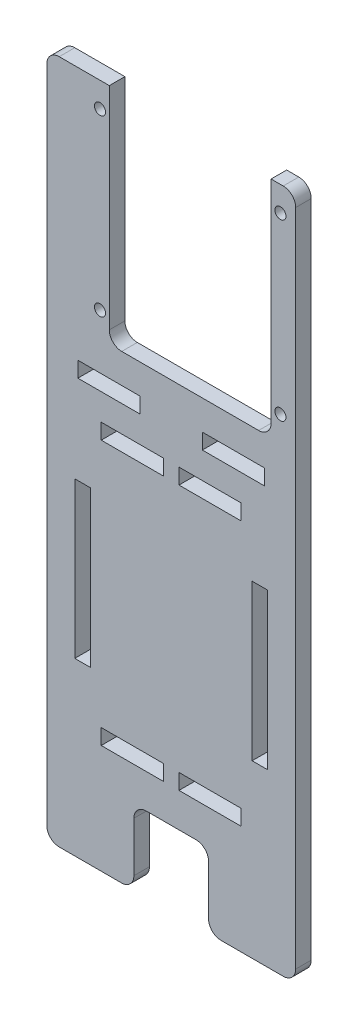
ISO-10303-21;
HEADER;
FILE_DESCRIPTION(('STEP AP214'),'2;1');
FILE_NAME('part.step','',(''),(''),'','','');
FILE_SCHEMA(('AUTOMOTIVE_DESIGN { 1 0 10303 214 1 1 1 1 }'));
ENDSEC;
DATA;
#1=APPLICATION_CONTEXT('core data for automotive mechanical design processes');
#2=APPLICATION_PROTOCOL_DEFINITION('international standard','automotive_design',2000,#1);
#3=PRODUCT_CONTEXT('',#1,'mechanical');
#4=PRODUCT('Part','Part','',(#3));
#5=PRODUCT_RELATED_PRODUCT_CATEGORY('part','',(#4));
#6=PRODUCT_DEFINITION_FORMATION('','',#4);
#7=PRODUCT_DEFINITION_CONTEXT('part definition',#1,'design');
#8=PRODUCT_DEFINITION('design','',#6,#7);
#9=PRODUCT_DEFINITION_SHAPE('','',#8);
#10=(LENGTH_UNIT() NAMED_UNIT(*) SI_UNIT(.MILLI.,.METRE.));
#11=(NAMED_UNIT(*) PLANE_ANGLE_UNIT() SI_UNIT($,.RADIAN.));
#12=(NAMED_UNIT(*) SI_UNIT($,.STERADIAN.) SOLID_ANGLE_UNIT());
#13=UNCERTAINTY_MEASURE_WITH_UNIT(LENGTH_MEASURE(1.E-05),#10,'distance_accuracy_value','');
#14=(GEOMETRIC_REPRESENTATION_CONTEXT(3) GLOBAL_UNCERTAINTY_ASSIGNED_CONTEXT((#13)) GLOBAL_UNIT_ASSIGNED_CONTEXT((#10,
#11,#12)) REPRESENTATION_CONTEXT('',''));
#15=CARTESIAN_POINT('',(0.,0.,0.));
#16=DIRECTION('',(0.,0.,1.));
#17=DIRECTION('',(1.,0.,0.));
#18=AXIS2_PLACEMENT_3D('',#15,#16,#17);
#19=CARTESIAN_POINT('',(-25.4,69.85,3.175));
#20=DIRECTION('',(0.,-1.,0.));
#21=DIRECTION('',(0.,0.,-1.));
#22=AXIS2_PLACEMENT_3D('',#19,#20,#21);
#23=PLANE('',#22);
#24=DIRECTION('',(-1.,0.,0.));
#25=VECTOR('',#24,1.);
#26=CARTESIAN_POINT('',(-25.4,69.85,3.175));
#27=LINE('',#26,#25);
#28=CARTESIAN_POINT('',(22.86,69.85,3.175));
#29=VERTEX_POINT('',#28);
#30=CARTESIAN_POINT('',(20.3824993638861,69.85,3.175));
#31=VERTEX_POINT('',#30);
#32=EDGE_CURVE('E829',#29,#31,#27,.T.);
#33=ORIENTED_EDGE('',*,*,#32,.F.);
#34=DIRECTION('',(0.,0.,-1.));
#35=VECTOR('',#34,1.);
#36=CARTESIAN_POINT('',(22.86,69.85,3.175));
#37=LINE('',#36,#35);
#38=CARTESIAN_POINT('',(22.86,69.85,0.));
#39=VERTEX_POINT('',#38);
#40=EDGE_CURVE('E920',#29,#39,#37,.T.);
#41=ORIENTED_EDGE('',*,*,#40,.T.);
#42=DIRECTION('',(-1.,0.,0.));
#43=VECTOR('',#42,1.);
#44=CARTESIAN_POINT('',(-25.4,69.85,0.));
#45=LINE('',#44,#43);
#46=CARTESIAN_POINT('',(20.3824993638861,69.85,0.));
#47=VERTEX_POINT('',#46);
#48=EDGE_CURVE('E845',#39,#47,#45,.T.);
#49=ORIENTED_EDGE('',*,*,#48,.T.);
#50=DIRECTION('',(0.,0.,1.));
#51=VECTOR('',#50,1.);
#52=CARTESIAN_POINT('',(20.3824993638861,69.85,0.));
#53=LINE('',#52,#51);
#54=EDGE_CURVE('E785',#47,#31,#53,.T.);
#55=ORIENTED_EDGE('',*,*,#54,.T.);
#56=EDGE_LOOP('',(#33,#41,#49,#55));
#57=FACE_BOUND('',#56,.T.);
#58=ADVANCED_FACE('F41',(#57),#23,.F.);
#59=CARTESIAN_POINT('',(-25.4,-69.85,3.175));
#60=DIRECTION('',(0.,1.,0.));
#61=DIRECTION('',(0.,0.,1.));
#62=AXIS2_PLACEMENT_3D('',#59,#60,#61);
#63=PLANE('',#62);
#64=DIRECTION('',(1.,0.,0.));
#65=VECTOR('',#64,1.);
#66=CARTESIAN_POINT('',(-25.4,-69.85,0.));
#67=LINE('',#66,#65);
#68=CARTESIAN_POINT('',(10.16,-69.85,0.));
#69=VERTEX_POINT('',#68);
#70=CARTESIAN_POINT('',(22.86,-69.85,0.));
#71=VERTEX_POINT('',#70);
#72=EDGE_CURVE('E852',#69,#71,#67,.T.);
#73=ORIENTED_EDGE('',*,*,#72,.T.);
#74=DIRECTION('',(0.,0.,-1.));
#75=VECTOR('',#74,1.);
#76=CARTESIAN_POINT('',(22.86,-69.85,3.175));
#77=LINE('',#76,#75);
#78=CARTESIAN_POINT('',(22.86,-69.85,3.175));
#79=VERTEX_POINT('',#78);
#80=EDGE_CURVE('E943',#71,#79,#77,.F.);
#81=ORIENTED_EDGE('',*,*,#80,.T.);
#82=DIRECTION('',(1.,0.,0.));
#83=VECTOR('',#82,1.);
#84=CARTESIAN_POINT('',(-25.4,-69.85,3.175));
#85=LINE('',#84,#83);
#86=CARTESIAN_POINT('',(10.16,-69.85,3.175));
#87=VERTEX_POINT('',#86);
#88=EDGE_CURVE('E836',#87,#79,#85,.T.);
#89=ORIENTED_EDGE('',*,*,#88,.F.);
#90=DIRECTION('',(0.,0.,-1.));
#91=VECTOR('',#90,1.);
#92=CARTESIAN_POINT('',(10.16,-69.85,3.175));
#93=LINE('',#92,#91);
#94=EDGE_CURVE('E939',#87,#69,#93,.T.);
#95=ORIENTED_EDGE('',*,*,#94,.T.);
#96=EDGE_LOOP('',(#73,#81,#89,#95));
#97=FACE_BOUND('',#96,.T.);
#98=ADVANCED_FACE('F1087',(#97),#63,.F.);
#99=CARTESIAN_POINT('',(25.4,-69.85,3.175));
#100=DIRECTION('',(-1.,0.,0.));
#101=DIRECTION('',(0.,0.,1.));
#102=AXIS2_PLACEMENT_3D('',#99,#100,#101);
#103=PLANE('',#102);
#104=DIRECTION('',(0.,1.,0.));
#105=VECTOR('',#104,1.);
#106=CARTESIAN_POINT('',(25.4,-69.85,0.));
#107=LINE('',#106,#105);
#108=CARTESIAN_POINT('',(25.4,-67.31,0.));
#109=VERTEX_POINT('',#108);
#110=CARTESIAN_POINT('',(25.4,67.31,0.));
#111=VERTEX_POINT('',#110);
#112=EDGE_CURVE('E812',#109,#111,#107,.T.);
#113=ORIENTED_EDGE('',*,*,#112,.T.);
#114=DIRECTION('',(0.,0.,-1.));
#115=VECTOR('',#114,1.);
#116=CARTESIAN_POINT('',(25.4,67.31,3.175));
#117=LINE('',#116,#115);
#118=CARTESIAN_POINT('',(25.4,67.31,3.175));
#119=VERTEX_POINT('',#118);
#120=EDGE_CURVE('E928',#111,#119,#117,.F.);
#121=ORIENTED_EDGE('',*,*,#120,.T.);
#122=DIRECTION('',(0.,1.,0.));
#123=VECTOR('',#122,1.);
#124=CARTESIAN_POINT('',(25.4,-69.85,3.175));
#125=LINE('',#124,#123);
#126=CARTESIAN_POINT('',(25.4,-67.31,3.175));
#127=VERTEX_POINT('',#126);
#128=EDGE_CURVE('E823',#127,#119,#125,.T.);
#129=ORIENTED_EDGE('',*,*,#128,.F.);
#130=DIRECTION('',(0.,0.,-1.));
#131=VECTOR('',#130,1.);
#132=CARTESIAN_POINT('',(25.4,-67.31,3.175));
#133=LINE('',#132,#131);
#134=EDGE_CURVE('E924',#127,#109,#133,.T.);
#135=ORIENTED_EDGE('',*,*,#134,.T.);
#136=EDGE_LOOP('',(#113,#121,#129,#135));
#137=FACE_BOUND('',#136,.T.);
#138=ADVANCED_FACE('F1076',(#137),#103,.F.);
#139=CARTESIAN_POINT('',(-12.6375006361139,69.85,0.));
#140=VERTEX_POINT('',#139);
#141=CARTESIAN_POINT('',(-22.86,69.85,0.));
#142=VERTEX_POINT('',#141);
#143=EDGE_CURVE('E844',#140,#142,#45,.T.);
#144=ORIENTED_EDGE('',*,*,#143,.T.);
#145=DIRECTION('',(0.,0.,-1.));
#146=VECTOR('',#145,1.);
#147=CARTESIAN_POINT('',(-22.86,69.85,3.175));
#148=LINE('',#147,#146);
#149=CARTESIAN_POINT('',(-22.86,69.85,3.175));
#150=VERTEX_POINT('',#149);
#151=EDGE_CURVE('E899',#142,#150,#148,.F.);
#152=ORIENTED_EDGE('',*,*,#151,.T.);
#153=CARTESIAN_POINT('',(-12.6375006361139,69.85,3.175));
#154=VERTEX_POINT('',#153);
#155=EDGE_CURVE('E827',#154,#150,#27,.T.);
#156=ORIENTED_EDGE('',*,*,#155,.F.);
#157=DIRECTION('',(0.,0.,1.));
#158=VECTOR('',#157,1.);
#159=CARTESIAN_POINT('',(-12.6375006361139,69.85,0.));
#160=LINE('',#159,#158);
#161=EDGE_CURVE('E796',#140,#154,#160,.T.);
#162=ORIENTED_EDGE('',*,*,#161,.F.);
#163=EDGE_LOOP('',(#144,#152,#156,#162));
#164=FACE_BOUND('',#163,.T.);
#165=ADVANCED_FACE('F1039',(#164),#23,.F.);
#166=CARTESIAN_POINT('',(-25.4,-69.85,3.175));
#167=DIRECTION('',(1.,0.,0.));
#168=DIRECTION('',(0.,0.,-1.));
#169=AXIS2_PLACEMENT_3D('',#166,#167,#168);
#170=PLANE('',#169);
#171=DIRECTION('',(0.,-1.,0.));
#172=VECTOR('',#171,1.);
#173=CARTESIAN_POINT('',(-25.4,-69.85,3.175));
#174=LINE('',#173,#172);
#175=CARTESIAN_POINT('',(-25.4,67.31,3.175));
#176=VERTEX_POINT('',#175);
#177=CARTESIAN_POINT('',(-25.4,-67.31,3.175));
#178=VERTEX_POINT('',#177);
#179=EDGE_CURVE('E832',#176,#178,#174,.T.);
#180=ORIENTED_EDGE('',*,*,#179,.F.);
#181=DIRECTION('',(0.,0.,-1.));
#182=VECTOR('',#181,1.);
#183=CARTESIAN_POINT('',(-25.4,67.31,3.175));
#184=LINE('',#183,#182);
#185=CARTESIAN_POINT('',(-25.4,67.31,0.));
#186=VERTEX_POINT('',#185);
#187=EDGE_CURVE('E877',#176,#186,#184,.T.);
#188=ORIENTED_EDGE('',*,*,#187,.T.);
#189=DIRECTION('',(0.,-1.,0.));
#190=VECTOR('',#189,1.);
#191=CARTESIAN_POINT('',(-25.4,-69.85,0.));
#192=LINE('',#191,#190);
#193=CARTESIAN_POINT('',(-25.4,-67.31,0.));
#194=VERTEX_POINT('',#193);
#195=EDGE_CURVE('E848',#186,#194,#192,.T.);
#196=ORIENTED_EDGE('',*,*,#195,.T.);
#197=DIRECTION('',(0.,0.,-1.));
#198=VECTOR('',#197,1.);
#199=CARTESIAN_POINT('',(-25.4,-67.31,3.175));
#200=LINE('',#199,#198);
#201=EDGE_CURVE('E874',#194,#178,#200,.F.);
#202=ORIENTED_EDGE('',*,*,#201,.T.);
#203=EDGE_LOOP('',(#180,#188,#196,#202));
#204=FACE_BOUND('',#203,.T.);
#205=ADVANCED_FACE('F1029',(#204),#170,.F.);
#206=CARTESIAN_POINT('',(-22.86,-69.85,3.175));
#207=VERTEX_POINT('',#206);
#208=CARTESIAN_POINT('',(-10.16,-69.85,3.175));
#209=VERTEX_POINT('',#208);
#210=EDGE_CURVE('E840',#207,#209,#85,.T.);
#211=ORIENTED_EDGE('',*,*,#210,.F.);
#212=DIRECTION('',(0.,0.,-1.));
#213=VECTOR('',#212,1.);
#214=CARTESIAN_POINT('',(-22.86,-69.85,3.175));
#215=LINE('',#214,#213);
#216=CARTESIAN_POINT('',(-22.86,-69.85,0.));
#217=VERTEX_POINT('',#216);
#218=EDGE_CURVE('E935',#207,#217,#215,.T.);
#219=ORIENTED_EDGE('',*,*,#218,.T.);
#220=CARTESIAN_POINT('',(-10.16,-69.85,0.));
#221=VERTEX_POINT('',#220);
#222=EDGE_CURVE('E828',#217,#221,#67,.T.);
#223=ORIENTED_EDGE('',*,*,#222,.T.);
#224=DIRECTION('',(0.,0.,1.));
#225=VECTOR('',#224,1.);
#226=CARTESIAN_POINT('',(-10.16,-69.85,3.175));
#227=LINE('',#226,#225);
#228=EDGE_CURVE('E931',#221,#209,#227,.T.);
#229=ORIENTED_EDGE('',*,*,#228,.T.);
#230=EDGE_LOOP('',(#211,#219,#223,#229));
#231=FACE_BOUND('',#230,.T.);
#232=ADVANCED_FACE('F1020',(#231),#63,.F.);
#233=CARTESIAN_POINT('',(0.,0.,3.175));
#234=DIRECTION('',(0.,0.,-1.));
#235=DIRECTION('',(-1.,0.,0.));
#236=AXIS2_PLACEMENT_3D('',#233,#234,#235);
#237=PLANE('',#236);
#238=DIRECTION('',(-1.,0.,0.));
#239=VECTOR('',#238,1.);
#240=CARTESIAN_POINT('',(6.35,18.0975,3.175));
#241=LINE('',#240,#239);
#242=CARTESIAN_POINT('',(19.05,18.0975,3.175));
#243=VERTEX_POINT('',#242);
#244=CARTESIAN_POINT('',(6.35,18.0975,3.175));
#245=VERTEX_POINT('',#244);
#246=EDGE_CURVE('E419',#243,#245,#241,.T.);
#247=ORIENTED_EDGE('',*,*,#246,.F.);
#248=DIRECTION('',(0.,1.,0.));
#249=VECTOR('',#248,1.);
#250=CARTESIAN_POINT('',(19.05,18.0975,3.175));
#251=LINE('',#250,#249);
#252=CARTESIAN_POINT('',(19.05,14.9225,3.175));
#253=VERTEX_POINT('',#252);
#254=EDGE_CURVE('E57',#253,#243,#251,.T.);
#255=ORIENTED_EDGE('',*,*,#254,.F.);
#256=DIRECTION('',(1.,0.,0.));
#257=VECTOR('',#256,1.);
#258=CARTESIAN_POINT('',(6.35,14.9225,3.175));
#259=LINE('',#258,#257);
#260=CARTESIAN_POINT('',(6.35,14.9225,3.175));
#261=VERTEX_POINT('',#260);
#262=EDGE_CURVE('E406',#261,#253,#259,.T.);
#263=ORIENTED_EDGE('',*,*,#262,.F.);
#264=DIRECTION('',(0.,-1.,0.));
#265=VECTOR('',#264,1.);
#266=CARTESIAN_POINT('',(6.35,18.0975,3.175));
#267=LINE('',#266,#265);
#268=EDGE_CURVE('E410',#245,#261,#267,.T.);
#269=ORIENTED_EDGE('',*,*,#268,.F.);
#270=EDGE_LOOP('',(#247,#255,#263,#269));
#271=FACE_BOUND('',#270,.T.);
#272=DIRECTION('',(-1.,0.,0.));
#273=VECTOR('',#272,1.);
#274=CARTESIAN_POINT('',(-6.35,18.0975,3.175));
#275=LINE('',#274,#273);
#276=CARTESIAN_POINT('',(-6.35,18.0975,3.175));
#277=VERTEX_POINT('',#276);
#278=CARTESIAN_POINT('',(-19.05,18.0975,3.175));
#279=VERTEX_POINT('',#278);
#280=EDGE_CURVE('E455',#277,#279,#275,.T.);
#281=ORIENTED_EDGE('',*,*,#280,.F.);
#282=DIRECTION('',(0.,1.,0.));
#283=VECTOR('',#282,1.);
#284=CARTESIAN_POINT('',(-6.35,18.0975,3.175));
#285=LINE('',#284,#283);
#286=CARTESIAN_POINT('',(-6.35,14.9225,3.175));
#287=VERTEX_POINT('',#286);
#288=EDGE_CURVE('E65',#287,#277,#285,.T.);
#289=ORIENTED_EDGE('',*,*,#288,.F.);
#290=DIRECTION('',(1.,0.,0.));
#291=VECTOR('',#290,1.);
#292=CARTESIAN_POINT('',(-6.35,14.9225,3.175));
#293=LINE('',#292,#291);
#294=CARTESIAN_POINT('',(-19.05,14.9225,3.175));
#295=VERTEX_POINT('',#294);
#296=EDGE_CURVE('E440',#295,#287,#293,.T.);
#297=ORIENTED_EDGE('',*,*,#296,.F.);
#298=DIRECTION('',(0.,-1.,0.));
#299=VECTOR('',#298,1.);
#300=CARTESIAN_POINT('',(-19.05,18.0975,3.175));
#301=LINE('',#300,#299);
#302=EDGE_CURVE('E459',#279,#295,#301,.T.);
#303=ORIENTED_EDGE('',*,*,#302,.F.);
#304=EDGE_LOOP('',(#281,#289,#297,#303));
#305=FACE_BOUND('',#304,.T.);
#306=DIRECTION('',(-1.,0.,0.));
#307=VECTOR('',#306,1.);
#308=CARTESIAN_POINT('',(16.51,-3.17500000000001,3.175));
#309=LINE('',#308,#307);
#310=CARTESIAN_POINT('',(19.685,-3.17500000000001,3.175));
#311=VERTEX_POINT('',#310);
#312=CARTESIAN_POINT('',(16.51,-3.17500000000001,3.175));
#313=VERTEX_POINT('',#312);
#314=EDGE_CURVE('E497',#311,#313,#309,.T.);
#315=ORIENTED_EDGE('',*,*,#314,.F.);
#316=DIRECTION('',(0.,1.,0.));
#317=VECTOR('',#316,1.);
#318=CARTESIAN_POINT('',(19.685,-3.17500000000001,3.175));
#319=LINE('',#318,#317);
#320=CARTESIAN_POINT('',(19.685,-34.925,3.175));
#321=VERTEX_POINT('',#320);
#322=EDGE_CURVE('E494',#321,#311,#319,.T.);
#323=ORIENTED_EDGE('',*,*,#322,.F.);
#324=DIRECTION('',(1.,0.,0.));
#325=VECTOR('',#324,1.);
#326=CARTESIAN_POINT('',(16.51,-34.925,3.175));
#327=LINE('',#326,#325);
#328=CARTESIAN_POINT('',(16.51,-34.925,3.175));
#329=VERTEX_POINT('',#328);
#330=EDGE_CURVE('E481',#329,#321,#327,.T.);
#331=ORIENTED_EDGE('',*,*,#330,.F.);
#332=DIRECTION('',(0.,-1.,0.));
#333=VECTOR('',#332,1.);
#334=CARTESIAN_POINT('',(16.51,-3.17500000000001,3.175));
#335=LINE('',#334,#333);
#336=EDGE_CURVE('E502',#313,#329,#335,.T.);
#337=ORIENTED_EDGE('',*,*,#336,.F.);
#338=EDGE_LOOP('',(#315,#323,#331,#337));
#339=FACE_BOUND('',#338,.T.);
#340=DIRECTION('',(1.,0.,0.));
#341=VECTOR('',#340,1.);
#342=CARTESIAN_POINT('',(1.5875,6.35000000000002,3.175));
#343=LINE('',#342,#341);
#344=CARTESIAN_POINT('',(1.5875,6.35000000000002,3.175));
#345=VERTEX_POINT('',#344);
#346=CARTESIAN_POINT('',(14.2875,6.35000000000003,3.175));
#347=VERTEX_POINT('',#346);
#348=EDGE_CURVE('E542',#345,#347,#343,.T.);
#349=ORIENTED_EDGE('',*,*,#348,.F.);
#350=DIRECTION('',(0.,-1.,0.));
#351=VECTOR('',#350,1.);
#352=CARTESIAN_POINT('',(1.5875,6.35000000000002,3.175));
#353=LINE('',#352,#351);
#354=CARTESIAN_POINT('',(1.58749999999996,9.52500000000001,3.175));
#355=VERTEX_POINT('',#354);
#356=EDGE_CURVE('E429',#355,#345,#353,.T.);
#357=ORIENTED_EDGE('',*,*,#356,.F.);
#358=DIRECTION('',(-1.,0.,0.));
#359=VECTOR('',#358,1.);
#360=CARTESIAN_POINT('',(1.58749999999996,9.52500000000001,3.175));
#361=LINE('',#360,#359);
#362=CARTESIAN_POINT('',(14.2875,9.52500000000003,3.175));
#363=VERTEX_POINT('',#362);
#364=EDGE_CURVE('E527',#363,#355,#361,.T.);
#365=ORIENTED_EDGE('',*,*,#364,.F.);
#366=DIRECTION('',(0.,1.,0.));
#367=VECTOR('',#366,1.);
#368=CARTESIAN_POINT('',(14.2875,6.35000000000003,3.175));
#369=LINE('',#368,#367);
#370=EDGE_CURVE('E546',#347,#363,#369,.T.);
#371=ORIENTED_EDGE('',*,*,#370,.F.);
#372=EDGE_LOOP('',(#349,#357,#365,#371));
#373=FACE_BOUND('',#372,.T.);
#374=DIRECTION('',(-1.,0.,0.));
#375=VECTOR('',#374,1.);
#376=CARTESIAN_POINT('',(1.58749999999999,-44.45,3.175));
#377=LINE('',#376,#375);
#378=CARTESIAN_POINT('',(14.2875,-44.45,3.175));
#379=VERTEX_POINT('',#378);
#380=CARTESIAN_POINT('',(1.58749999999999,-44.45,3.175));
#381=VERTEX_POINT('',#380);
#382=EDGE_CURVE('E675',#379,#381,#377,.T.);
#383=ORIENTED_EDGE('',*,*,#382,.F.);
#384=DIRECTION('',(0.,1.,0.));
#385=VECTOR('',#384,1.);
#386=CARTESIAN_POINT('',(14.2875,-44.45,3.175));
#387=LINE('',#386,#385);
#388=CARTESIAN_POINT('',(14.2875,-47.625,3.175));
#389=VERTEX_POINT('',#388);
#390=EDGE_CURVE('E672',#389,#379,#387,.T.);
#391=ORIENTED_EDGE('',*,*,#390,.F.);
#392=DIRECTION('',(1.,0.,0.));
#393=VECTOR('',#392,1.);
#394=CARTESIAN_POINT('',(1.58749999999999,-47.625,3.175));
#395=LINE('',#394,#393);
#396=CARTESIAN_POINT('',(1.58749999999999,-47.625,3.175));
#397=VERTEX_POINT('',#396);
#398=EDGE_CURVE('E659',#397,#389,#395,.T.);
#399=ORIENTED_EDGE('',*,*,#398,.F.);
#400=DIRECTION('',(0.,-1.,0.));
#401=VECTOR('',#400,1.);
#402=CARTESIAN_POINT('',(1.58749999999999,-44.45,3.175));
#403=LINE('',#402,#401);
#404=EDGE_CURVE('E680',#381,#397,#403,.T.);
#405=ORIENTED_EDGE('',*,*,#404,.F.);
#406=EDGE_LOOP('',(#383,#391,#399,#405));
#407=FACE_BOUND('',#406,.T.);
#408=DIRECTION('',(-1.,0.,0.));
#409=VECTOR('',#408,1.);
#410=CARTESIAN_POINT('',(-16.51,-3.17500000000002,3.175));
#411=LINE('',#410,#409);
#412=CARTESIAN_POINT('',(-16.51,-3.17500000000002,3.175));
#413=VERTEX_POINT('',#412);
#414=CARTESIAN_POINT('',(-19.685,-3.17500000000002,3.175));
#415=VERTEX_POINT('',#414);
#416=EDGE_CURVE('E718',#413,#415,#411,.T.);
#417=ORIENTED_EDGE('',*,*,#416,.F.);
#418=DIRECTION('',(0.,1.,0.));
#419=VECTOR('',#418,1.);
#420=CARTESIAN_POINT('',(-16.51,-3.17500000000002,3.175));
#421=LINE('',#420,#419);
#422=CARTESIAN_POINT('',(-16.51,-34.925,3.175));
#423=VERTEX_POINT('',#422);
#424=EDGE_CURVE('E602',#423,#413,#421,.T.);
#425=ORIENTED_EDGE('',*,*,#424,.F.);
#426=DIRECTION('',(1.,0.,0.));
#427=VECTOR('',#426,1.);
#428=CARTESIAN_POINT('',(-16.51,-34.925,3.175));
#429=LINE('',#428,#427);
#430=CARTESIAN_POINT('',(-19.685,-34.925,3.175));
#431=VERTEX_POINT('',#430);
#432=EDGE_CURVE('E703',#431,#423,#429,.T.);
#433=ORIENTED_EDGE('',*,*,#432,.F.);
#434=DIRECTION('',(0.,-1.,0.));
#435=VECTOR('',#434,1.);
#436=CARTESIAN_POINT('',(-19.685,-3.17500000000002,3.175));
#437=LINE('',#436,#435);
#438=EDGE_CURVE('E722',#415,#431,#437,.T.);
#439=ORIENTED_EDGE('',*,*,#438,.F.);
#440=EDGE_LOOP('',(#417,#425,#433,#439));
#441=FACE_BOUND('',#440,.T.);
#442=DIRECTION('',(-1.,0.,0.));
#443=VECTOR('',#442,1.);
#444=CARTESIAN_POINT('',(-1.58749999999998,-44.45,3.175));
#445=LINE('',#444,#443);
#446=CARTESIAN_POINT('',(-1.58749999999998,-44.45,3.175));
#447=VERTEX_POINT('',#446);
#448=CARTESIAN_POINT('',(-14.2875,-44.45,3.175));
#449=VERTEX_POINT('',#448);
#450=EDGE_CURVE('E587',#447,#449,#445,.T.);
#451=ORIENTED_EDGE('',*,*,#450,.F.);
#452=DIRECTION('',(0.,1.,0.));
#453=VECTOR('',#452,1.);
#454=CARTESIAN_POINT('',(-1.58749999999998,-44.45,3.175));
#455=LINE('',#454,#453);
#456=CARTESIAN_POINT('',(-1.58749999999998,-47.625,3.175));
#457=VERTEX_POINT('',#456);
#458=EDGE_CURVE('E584',#457,#447,#455,.T.);
#459=ORIENTED_EDGE('',*,*,#458,.F.);
#460=DIRECTION('',(1.,0.,0.));
#461=VECTOR('',#460,1.);
#462=CARTESIAN_POINT('',(-1.58749999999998,-47.625,3.175));
#463=LINE('',#462,#461);
#464=CARTESIAN_POINT('',(-14.2875,-47.625,3.175));
#465=VERTEX_POINT('',#464);
#466=EDGE_CURVE('E571',#465,#457,#463,.T.);
#467=ORIENTED_EDGE('',*,*,#466,.F.);
#468=DIRECTION('',(0.,-1.,0.));
#469=VECTOR('',#468,1.);
#470=CARTESIAN_POINT('',(-14.2875,-44.45,3.175));
#471=LINE('',#470,#469);
#472=EDGE_CURVE('E592',#449,#465,#471,.T.);
#473=ORIENTED_EDGE('',*,*,#472,.F.);
#474=EDGE_LOOP('',(#451,#459,#467,#473));
#475=FACE_BOUND('',#474,.T.);
#476=DIRECTION('',(-1.,0.,0.));
#477=VECTOR('',#476,1.);
#478=CARTESIAN_POINT('',(-1.58749999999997,9.52500000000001,3.175));
#479=LINE('',#478,#477);
#480=CARTESIAN_POINT('',(-1.58749999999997,9.52500000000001,3.175));
#481=VERTEX_POINT('',#480);
#482=CARTESIAN_POINT('',(-14.2875,9.52500000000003,3.175));
#483=VERTEX_POINT('',#482);
#484=EDGE_CURVE('E632',#481,#483,#479,.T.);
#485=ORIENTED_EDGE('',*,*,#484,.F.);
#486=DIRECTION('',(0.,1.,0.));
#487=VECTOR('',#486,1.);
#488=CARTESIAN_POINT('',(-1.5875,6.35000000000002,3.175));
#489=LINE('',#488,#487);
#490=CARTESIAN_POINT('',(-1.5875,6.35000000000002,3.175));
#491=VERTEX_POINT('',#490);
#492=EDGE_CURVE('E556',#491,#481,#489,.T.);
#493=ORIENTED_EDGE('',*,*,#492,.F.);
#494=DIRECTION('',(1.,0.,0.));
#495=VECTOR('',#494,1.);
#496=CARTESIAN_POINT('',(-1.5875,6.35000000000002,3.175));
#497=LINE('',#496,#495);
#498=CARTESIAN_POINT('',(-14.2875,6.35000000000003,3.175));
#499=VERTEX_POINT('',#498);
#500=EDGE_CURVE('E617',#499,#491,#497,.T.);
#501=ORIENTED_EDGE('',*,*,#500,.F.);
#502=DIRECTION('',(0.,-1.,0.));
#503=VECTOR('',#502,1.);
#504=CARTESIAN_POINT('',(-14.2875,6.35000000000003,3.175));
#505=LINE('',#504,#503);
#506=EDGE_CURVE('E636',#483,#499,#505,.T.);
#507=ORIENTED_EDGE('',*,*,#506,.F.);
#508=EDGE_LOOP('',(#485,#493,#501,#507));
#509=FACE_BOUND('',#508,.T.);
#510=CARTESIAN_POINT('',(-14.5425006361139,64.77,3.175));
#511=DIRECTION('',(0.,0.,1.));
#512=DIRECTION('',(1.,0.,0.));
#513=AXIS2_PLACEMENT_3D('',#510,#511,#512);
#514=CIRCLE('',#513,1.13029999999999);
#515=CARTESIAN_POINT('',(-13.412200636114,64.77,3.175));
#516=VERTEX_POINT('',#515);
#517=EDGE_CURVE('E512',#516,#516,#514,.T.);
#518=ORIENTED_EDGE('',*,*,#517,.F.);
#519=EDGE_LOOP('',(#518));
#520=FACE_BOUND('',#519,.T.);
#521=CARTESIAN_POINT('',(-14.5425006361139,29.21,3.175));
#522=DIRECTION('',(0.,0.,1.));
#523=DIRECTION('',(1.,0.,0.));
#524=AXIS2_PLACEMENT_3D('',#521,#522,#523);
#525=CIRCLE('',#524,1.13029999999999);
#526=CARTESIAN_POINT('',(-13.412200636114,29.21,3.175));
#527=VERTEX_POINT('',#526);
#528=EDGE_CURVE('E747',#527,#527,#525,.T.);
#529=ORIENTED_EDGE('',*,*,#528,.F.);
#530=EDGE_LOOP('',(#529));
#531=FACE_BOUND('',#530,.T.);
#532=CARTESIAN_POINT('',(22.2874993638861,64.77,3.175));
#533=DIRECTION('',(0.,0.,1.));
#534=DIRECTION('',(1.,0.,0.));
#535=AXIS2_PLACEMENT_3D('',#532,#533,#534);
#536=CIRCLE('',#535,1.13029999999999);
#537=CARTESIAN_POINT('',(23.4177993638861,64.77,3.175));
#538=VERTEX_POINT('',#537);
#539=EDGE_CURVE('E755',#538,#538,#536,.T.);
#540=ORIENTED_EDGE('',*,*,#539,.F.);
#541=EDGE_LOOP('',(#540));
#542=FACE_BOUND('',#541,.T.);
#543=CARTESIAN_POINT('',(22.2874993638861,29.21,3.175));
#544=DIRECTION('',(0.,0.,1.));
#545=DIRECTION('',(1.,0.,0.));
#546=AXIS2_PLACEMENT_3D('',#543,#544,#545);
#547=CIRCLE('',#546,1.13029999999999);
#548=CARTESIAN_POINT('',(23.4177993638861,29.21,3.175));
#549=VERTEX_POINT('',#548);
#550=EDGE_CURVE('E763',#549,#549,#547,.T.);
#551=ORIENTED_EDGE('',*,*,#550,.F.);
#552=EDGE_LOOP('',(#551));
#553=FACE_BOUND('',#552,.T.);
#554=ORIENTED_EDGE('',*,*,#155,.T.);
#555=CARTESIAN_POINT('',(-22.86,67.31,3.175));
#556=DIRECTION('',(0.,0.,-1.));
#557=DIRECTION('',(-1.,0.,0.));
#558=AXIS2_PLACEMENT_3D('',#555,#556,#557);
#559=CIRCLE('',#558,2.54);
#560=EDGE_CURVE('E917',#150,#176,#559,.F.);
#561=ORIENTED_EDGE('',*,*,#560,.T.);
#562=ORIENTED_EDGE('',*,*,#179,.T.);
#563=CARTESIAN_POINT('',(-22.86,-67.31,3.175));
#564=DIRECTION('',(0.,0.,-1.));
#565=DIRECTION('',(-1.,0.,0.));
#566=AXIS2_PLACEMENT_3D('',#563,#564,#565);
#567=CIRCLE('',#566,2.54);
#568=EDGE_CURVE('E911',#178,#207,#567,.F.);
#569=ORIENTED_EDGE('',*,*,#568,.T.);
#570=ORIENTED_EDGE('',*,*,#210,.T.);
#571=CARTESIAN_POINT('',(-10.16,-67.31,3.175));
#572=DIRECTION('',(0.,0.,-1.));
#573=DIRECTION('',(-1.,0.,0.));
#574=AXIS2_PLACEMENT_3D('',#571,#572,#573);
#575=CIRCLE('',#574,2.54);
#576=CARTESIAN_POINT('',(-7.61999999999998,-67.31,3.175));
#577=VERTEX_POINT('',#576);
#578=EDGE_CURVE('E905',#209,#577,#575,.F.);
#579=ORIENTED_EDGE('',*,*,#578,.T.);
#580=DIRECTION('',(0.,-1.,0.));
#581=VECTOR('',#580,1.);
#582=CARTESIAN_POINT('',(-7.61999999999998,-54.61,3.175));
#583=LINE('',#582,#581);
#584=CARTESIAN_POINT('',(-7.61999999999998,-57.15,3.175));
#585=VERTEX_POINT('',#584);
#586=EDGE_CURVE('E808',#585,#577,#583,.T.);
#587=ORIENTED_EDGE('',*,*,#586,.F.);
#588=CARTESIAN_POINT('',(-5.07999999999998,-57.15,3.175));
#589=DIRECTION('',(0.,0.,-1.));
#590=DIRECTION('',(-1.,0.,0.));
#591=AXIS2_PLACEMENT_3D('',#588,#589,#590);
#592=CIRCLE('',#591,2.54);
#593=CARTESIAN_POINT('',(-5.07999999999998,-54.61,3.175));
#594=VERTEX_POINT('',#593);
#595=EDGE_CURVE('E978',#585,#594,#592,.T.);
#596=ORIENTED_EDGE('',*,*,#595,.T.);
#597=DIRECTION('',(-1.,0.,0.));
#598=VECTOR('',#597,1.);
#599=CARTESIAN_POINT('',(-7.61999999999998,-54.61,3.175));
#600=LINE('',#599,#598);
#601=CARTESIAN_POINT('',(5.08000000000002,-54.61,3.175));
#602=VERTEX_POINT('',#601);
#603=EDGE_CURVE('E816',#602,#594,#600,.T.);
#604=ORIENTED_EDGE('',*,*,#603,.F.);
#605=CARTESIAN_POINT('',(5.08000000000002,-57.15,3.175));
#606=DIRECTION('',(0.,0.,-1.));
#607=DIRECTION('',(-1.,0.,0.));
#608=AXIS2_PLACEMENT_3D('',#605,#606,#607);
#609=CIRCLE('',#608,2.54);
#610=CARTESIAN_POINT('',(7.62000000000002,-57.15,3.175));
#611=VERTEX_POINT('',#610);
#612=EDGE_CURVE('E50',#602,#611,#609,.T.);
#613=ORIENTED_EDGE('',*,*,#612,.T.);
#614=DIRECTION('',(0.,1.,0.));
#615=VECTOR('',#614,1.);
#616=CARTESIAN_POINT('',(7.62000000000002,-54.61,3.175));
#617=LINE('',#616,#615);
#618=CARTESIAN_POINT('',(7.62000000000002,-67.31,3.175));
#619=VERTEX_POINT('',#618);
#620=EDGE_CURVE('E799',#619,#611,#617,.T.);
#621=ORIENTED_EDGE('',*,*,#620,.F.);
#622=CARTESIAN_POINT('',(10.16,-67.31,3.175));
#623=DIRECTION('',(0.,0.,-1.));
#624=DIRECTION('',(-1.,0.,0.));
#625=AXIS2_PLACEMENT_3D('',#622,#623,#624);
#626=CIRCLE('',#625,2.54);
#627=EDGE_CURVE('E902',#619,#87,#626,.F.);
#628=ORIENTED_EDGE('',*,*,#627,.T.);
#629=ORIENTED_EDGE('',*,*,#88,.T.);
#630=CARTESIAN_POINT('',(22.86,-67.31,3.175));
#631=DIRECTION('',(0.,0.,-1.));
#632=DIRECTION('',(-1.,0.,0.));
#633=AXIS2_PLACEMENT_3D('',#630,#631,#632);
#634=CIRCLE('',#633,2.54);
#635=EDGE_CURVE('E908',#79,#127,#634,.F.);
#636=ORIENTED_EDGE('',*,*,#635,.T.);
#637=ORIENTED_EDGE('',*,*,#128,.T.);
#638=CARTESIAN_POINT('',(22.86,67.31,3.175));
#639=DIRECTION('',(0.,0.,-1.));
#640=DIRECTION('',(-1.,0.,0.));
#641=AXIS2_PLACEMENT_3D('',#638,#639,#640);
#642=CIRCLE('',#641,2.54);
#643=EDGE_CURVE('E914',#119,#29,#642,.F.);
#644=ORIENTED_EDGE('',*,*,#643,.T.);
#645=ORIENTED_EDGE('',*,*,#32,.T.);
#646=DIRECTION('',(0.,1.,0.));
#647=VECTOR('',#646,1.);
#648=CARTESIAN_POINT('',(20.3824993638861,69.85,3.175));
#649=LINE('',#648,#647);
#650=CARTESIAN_POINT('',(20.3824993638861,26.67,3.175));
#651=VERTEX_POINT('',#650);
#652=EDGE_CURVE('E771',#651,#31,#649,.T.);
#653=ORIENTED_EDGE('',*,*,#652,.F.);
#654=CARTESIAN_POINT('',(17.8424993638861,26.67,3.175));
#655=DIRECTION('',(0.,0.,-1.));
#656=DIRECTION('',(-1.,0.,0.));
#657=AXIS2_PLACEMENT_3D('',#654,#655,#656);
#658=CIRCLE('',#657,2.54);
#659=CARTESIAN_POINT('',(17.8424993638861,24.13,3.175));
#660=VERTEX_POINT('',#659);
#661=EDGE_CURVE('E966',#651,#660,#658,.T.);
#662=ORIENTED_EDGE('',*,*,#661,.T.);
#663=DIRECTION('',(1.,0.,0.));
#664=VECTOR('',#663,1.);
#665=CARTESIAN_POINT('',(-12.6375006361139,24.13,3.175));
#666=LINE('',#665,#664);
#667=CARTESIAN_POINT('',(-10.0975006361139,24.13,3.175));
#668=VERTEX_POINT('',#667);
#669=EDGE_CURVE('E777',#668,#660,#666,.T.);
#670=ORIENTED_EDGE('',*,*,#669,.F.);
#671=CARTESIAN_POINT('',(-10.0975006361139,26.67,3.175));
#672=DIRECTION('',(0.,0.,-1.));
#673=DIRECTION('',(-1.,0.,0.));
#674=AXIS2_PLACEMENT_3D('',#671,#672,#673);
#675=CIRCLE('',#674,2.54);
#676=CARTESIAN_POINT('',(-12.6375006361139,26.67,3.175));
#677=VERTEX_POINT('',#676);
#678=EDGE_CURVE('E972',#668,#677,#675,.T.);
#679=ORIENTED_EDGE('',*,*,#678,.T.);
#680=DIRECTION('',(0.,-1.,0.));
#681=VECTOR('',#680,1.);
#682=CARTESIAN_POINT('',(-12.6375006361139,69.85,3.175));
#683=LINE('',#682,#681);
#684=EDGE_CURVE('E789',#154,#677,#683,.T.);
#685=ORIENTED_EDGE('',*,*,#684,.F.);
#686=EDGE_LOOP('',(#554,#561,#562,#569,#570,#579,#587,#596,#604,#613,#621,#628,#629,#636,#637,
#644,#645,#653,#662,#670,#679,#685));
#687=FACE_BOUND('',#686,.T.);
#688=ADVANCED_FACE('F988',(#271,#305,#339,#373,#407,#441,#475,#509,#520,#531,#542,#553,#687),
#237,.F.);
#689=CARTESIAN_POINT('',(0.,0.,0.));
#690=DIRECTION('',(0.,0.,-1.));
#691=DIRECTION('',(-1.,0.,0.));
#692=AXIS2_PLACEMENT_3D('',#689,#690,#691);
#693=PLANE('',#692);
#694=DIRECTION('',(0.,1.,0.));
#695=VECTOR('',#694,1.);
#696=CARTESIAN_POINT('',(19.05,18.0975,0.));
#697=LINE('',#696,#695);
#698=CARTESIAN_POINT('',(19.05,14.9225,0.));
#699=VERTEX_POINT('',#698);
#700=CARTESIAN_POINT('',(19.05,18.0975,0.));
#701=VERTEX_POINT('',#700);
#702=EDGE_CURVE('E384',#699,#701,#697,.T.);
#703=ORIENTED_EDGE('',*,*,#702,.T.);
#704=DIRECTION('',(-1.,0.,0.));
#705=VECTOR('',#704,1.);
#706=CARTESIAN_POINT('',(6.35,18.0975,0.));
#707=LINE('',#706,#705);
#708=CARTESIAN_POINT('',(6.35,18.0975,0.));
#709=VERTEX_POINT('',#708);
#710=EDGE_CURVE('E395',#701,#709,#707,.T.);
#711=ORIENTED_EDGE('',*,*,#710,.T.);
#712=DIRECTION('',(0.,-1.,0.));
#713=VECTOR('',#712,1.);
#714=CARTESIAN_POINT('',(6.35,18.0975,0.));
#715=LINE('',#714,#713);
#716=CARTESIAN_POINT('',(6.35,14.9225,0.));
#717=VERTEX_POINT('',#716);
#718=EDGE_CURVE('E400',#709,#717,#715,.T.);
#719=ORIENTED_EDGE('',*,*,#718,.T.);
#720=DIRECTION('',(1.,0.,0.));
#721=VECTOR('',#720,1.);
#722=CARTESIAN_POINT('',(6.35,14.9225,0.));
#723=LINE('',#722,#721);
#724=EDGE_CURVE('E391',#717,#699,#723,.T.);
#725=ORIENTED_EDGE('',*,*,#724,.T.);
#726=EDGE_LOOP('',(#703,#711,#719,#725));
#727=FACE_BOUND('',#726,.T.);
#728=DIRECTION('',(0.,1.,0.));
#729=VECTOR('',#728,1.);
#730=CARTESIAN_POINT('',(-6.35,18.0975,0.));
#731=LINE('',#730,#729);
#732=CARTESIAN_POINT('',(-6.35,14.9225,0.));
#733=VERTEX_POINT('',#732);
#734=CARTESIAN_POINT('',(-6.35,18.0975,0.));
#735=VERTEX_POINT('',#734);
#736=EDGE_CURVE('E435',#733,#735,#731,.T.);
#737=ORIENTED_EDGE('',*,*,#736,.T.);
#738=DIRECTION('',(-1.,0.,0.));
#739=VECTOR('',#738,1.);
#740=CARTESIAN_POINT('',(-6.35,18.0975,0.));
#741=LINE('',#740,#739);
#742=CARTESIAN_POINT('',(-19.05,18.0975,0.));
#743=VERTEX_POINT('',#742);
#744=EDGE_CURVE('E439',#735,#743,#741,.T.);
#745=ORIENTED_EDGE('',*,*,#744,.T.);
#746=DIRECTION('',(0.,-1.,0.));
#747=VECTOR('',#746,1.);
#748=CARTESIAN_POINT('',(-19.05,18.0975,0.));
#749=LINE('',#748,#747);
#750=CARTESIAN_POINT('',(-19.05,14.9225,0.));
#751=VERTEX_POINT('',#750);
#752=EDGE_CURVE('E444',#743,#751,#749,.T.);
#753=ORIENTED_EDGE('',*,*,#752,.T.);
#754=DIRECTION('',(1.,0.,0.));
#755=VECTOR('',#754,1.);
#756=CARTESIAN_POINT('',(-6.35,14.9225,0.));
#757=LINE('',#756,#755);
#758=EDGE_CURVE('E448',#751,#733,#757,.T.);
#759=ORIENTED_EDGE('',*,*,#758,.T.);
#760=EDGE_LOOP('',(#737,#745,#753,#759));
#761=FACE_BOUND('',#760,.T.);
#762=DIRECTION('',(0.,1.,0.));
#763=VECTOR('',#762,1.);
#764=CARTESIAN_POINT('',(19.685,-3.17500000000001,0.));
#765=LINE('',#764,#763);
#766=CARTESIAN_POINT('',(19.685,-34.925,0.));
#767=VERTEX_POINT('',#766);
#768=CARTESIAN_POINT('',(19.685,-3.17500000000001,0.));
#769=VERTEX_POINT('',#768);
#770=EDGE_CURVE('E476',#767,#769,#765,.T.);
#771=ORIENTED_EDGE('',*,*,#770,.T.);
#772=DIRECTION('',(-1.,0.,0.));
#773=VECTOR('',#772,1.);
#774=CARTESIAN_POINT('',(16.51,-3.17500000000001,0.));
#775=LINE('',#774,#773);
#776=CARTESIAN_POINT('',(16.51,-3.17500000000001,0.));
#777=VERTEX_POINT('',#776);
#778=EDGE_CURVE('E480',#769,#777,#775,.T.);
#779=ORIENTED_EDGE('',*,*,#778,.T.);
#780=DIRECTION('',(0.,-1.,0.));
#781=VECTOR('',#780,1.);
#782=CARTESIAN_POINT('',(16.51,-3.17500000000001,0.));
#783=LINE('',#782,#781);
#784=CARTESIAN_POINT('',(16.51,-34.925,0.));
#785=VERTEX_POINT('',#784);
#786=EDGE_CURVE('E485',#777,#785,#783,.T.);
#787=ORIENTED_EDGE('',*,*,#786,.T.);
#788=DIRECTION('',(1.,0.,0.));
#789=VECTOR('',#788,1.);
#790=CARTESIAN_POINT('',(16.51,-34.925,0.));
#791=LINE('',#790,#789);
#792=EDGE_CURVE('E489',#785,#767,#791,.T.);
#793=ORIENTED_EDGE('',*,*,#792,.T.);
#794=EDGE_LOOP('',(#771,#779,#787,#793));
#795=FACE_BOUND('',#794,.T.);
#796=DIRECTION('',(0.,-1.,0.));
#797=VECTOR('',#796,1.);
#798=CARTESIAN_POINT('',(1.5875,6.35000000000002,0.));
#799=LINE('',#798,#797);
#800=CARTESIAN_POINT('',(1.58749999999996,9.52500000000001,0.));
#801=VERTEX_POINT('',#800);
#802=CARTESIAN_POINT('',(1.5875,6.35000000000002,0.));
#803=VERTEX_POINT('',#802);
#804=EDGE_CURVE('E522',#801,#803,#799,.T.);
#805=ORIENTED_EDGE('',*,*,#804,.T.);
#806=DIRECTION('',(1.,0.,0.));
#807=VECTOR('',#806,1.);
#808=CARTESIAN_POINT('',(1.5875,6.35000000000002,0.));
#809=LINE('',#808,#807);
#810=CARTESIAN_POINT('',(14.2875,6.35000000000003,0.));
#811=VERTEX_POINT('',#810);
#812=EDGE_CURVE('E526',#803,#811,#809,.T.);
#813=ORIENTED_EDGE('',*,*,#812,.T.);
#814=DIRECTION('',(0.,1.,0.));
#815=VECTOR('',#814,1.);
#816=CARTESIAN_POINT('',(14.2875,6.35000000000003,0.));
#817=LINE('',#816,#815);
#818=CARTESIAN_POINT('',(14.2875,9.52500000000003,0.));
#819=VERTEX_POINT('',#818);
#820=EDGE_CURVE('E531',#811,#819,#817,.T.);
#821=ORIENTED_EDGE('',*,*,#820,.T.);
#822=DIRECTION('',(-1.,0.,0.));
#823=VECTOR('',#822,1.);
#824=CARTESIAN_POINT('',(1.58749999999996,9.52500000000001,0.));
#825=LINE('',#824,#823);
#826=EDGE_CURVE('E535',#819,#801,#825,.T.);
#827=ORIENTED_EDGE('',*,*,#826,.T.);
#828=EDGE_LOOP('',(#805,#813,#821,#827));
#829=FACE_BOUND('',#828,.T.);
#830=DIRECTION('',(0.,1.,0.));
#831=VECTOR('',#830,1.);
#832=CARTESIAN_POINT('',(14.2875,-44.45,0.));
#833=LINE('',#832,#831);
#834=CARTESIAN_POINT('',(14.2875,-47.625,0.));
#835=VERTEX_POINT('',#834);
#836=CARTESIAN_POINT('',(14.2875,-44.45,0.));
#837=VERTEX_POINT('',#836);
#838=EDGE_CURVE('E654',#835,#837,#833,.T.);
#839=ORIENTED_EDGE('',*,*,#838,.T.);
#840=DIRECTION('',(-1.,0.,0.));
#841=VECTOR('',#840,1.);
#842=CARTESIAN_POINT('',(1.58749999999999,-44.45,0.));
#843=LINE('',#842,#841);
#844=CARTESIAN_POINT('',(1.58749999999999,-44.45,0.));
#845=VERTEX_POINT('',#844);
#846=EDGE_CURVE('E658',#837,#845,#843,.T.);
#847=ORIENTED_EDGE('',*,*,#846,.T.);
#848=DIRECTION('',(0.,-1.,0.));
#849=VECTOR('',#848,1.);
#850=CARTESIAN_POINT('',(1.58749999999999,-44.45,0.));
#851=LINE('',#850,#849);
#852=CARTESIAN_POINT('',(1.58749999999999,-47.625,0.));
#853=VERTEX_POINT('',#852);
#854=EDGE_CURVE('E663',#845,#853,#851,.T.);
#855=ORIENTED_EDGE('',*,*,#854,.T.);
#856=DIRECTION('',(1.,0.,0.));
#857=VECTOR('',#856,1.);
#858=CARTESIAN_POINT('',(1.58749999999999,-47.625,0.));
#859=LINE('',#858,#857);
#860=EDGE_CURVE('E667',#853,#835,#859,.T.);
#861=ORIENTED_EDGE('',*,*,#860,.T.);
#862=EDGE_LOOP('',(#839,#847,#855,#861));
#863=FACE_BOUND('',#862,.T.);
#864=DIRECTION('',(0.,1.,0.));
#865=VECTOR('',#864,1.);
#866=CARTESIAN_POINT('',(-16.51,-3.17500000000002,0.));
#867=LINE('',#866,#865);
#868=CARTESIAN_POINT('',(-16.51,-34.925,0.));
#869=VERTEX_POINT('',#868);
#870=CARTESIAN_POINT('',(-16.51,-3.17500000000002,0.));
#871=VERTEX_POINT('',#870);
#872=EDGE_CURVE('E698',#869,#871,#867,.T.);
#873=ORIENTED_EDGE('',*,*,#872,.T.);
#874=DIRECTION('',(-1.,0.,0.));
#875=VECTOR('',#874,1.);
#876=CARTESIAN_POINT('',(-16.51,-3.17500000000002,0.));
#877=LINE('',#876,#875);
#878=CARTESIAN_POINT('',(-19.685,-3.17500000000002,0.));
#879=VERTEX_POINT('',#878);
#880=EDGE_CURVE('E702',#871,#879,#877,.T.);
#881=ORIENTED_EDGE('',*,*,#880,.T.);
#882=DIRECTION('',(0.,-1.,0.));
#883=VECTOR('',#882,1.);
#884=CARTESIAN_POINT('',(-19.685,-3.17500000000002,0.));
#885=LINE('',#884,#883);
#886=CARTESIAN_POINT('',(-19.685,-34.925,0.));
#887=VERTEX_POINT('',#886);
#888=EDGE_CURVE('E707',#879,#887,#885,.T.);
#889=ORIENTED_EDGE('',*,*,#888,.T.);
#890=DIRECTION('',(1.,0.,0.));
#891=VECTOR('',#890,1.);
#892=CARTESIAN_POINT('',(-16.51,-34.925,0.));
#893=LINE('',#892,#891);
#894=EDGE_CURVE('E711',#887,#869,#893,.T.);
#895=ORIENTED_EDGE('',*,*,#894,.T.);
#896=EDGE_LOOP('',(#873,#881,#889,#895));
#897=FACE_BOUND('',#896,.T.);
#898=DIRECTION('',(0.,1.,0.));
#899=VECTOR('',#898,1.);
#900=CARTESIAN_POINT('',(-1.58749999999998,-44.45,0.));
#901=LINE('',#900,#899);
#902=CARTESIAN_POINT('',(-1.58749999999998,-47.625,0.));
#903=VERTEX_POINT('',#902);
#904=CARTESIAN_POINT('',(-1.58749999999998,-44.45,0.));
#905=VERTEX_POINT('',#904);
#906=EDGE_CURVE('E566',#903,#905,#901,.T.);
#907=ORIENTED_EDGE('',*,*,#906,.T.);
#908=DIRECTION('',(-1.,0.,0.));
#909=VECTOR('',#908,1.);
#910=CARTESIAN_POINT('',(-1.58749999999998,-44.45,0.));
#911=LINE('',#910,#909);
#912=CARTESIAN_POINT('',(-14.2875,-44.45,0.));
#913=VERTEX_POINT('',#912);
#914=EDGE_CURVE('E570',#905,#913,#911,.T.);
#915=ORIENTED_EDGE('',*,*,#914,.T.);
#916=DIRECTION('',(0.,-1.,0.));
#917=VECTOR('',#916,1.);
#918=CARTESIAN_POINT('',(-14.2875,-44.45,0.));
#919=LINE('',#918,#917);
#920=CARTESIAN_POINT('',(-14.2875,-47.625,0.));
#921=VERTEX_POINT('',#920);
#922=EDGE_CURVE('E575',#913,#921,#919,.T.);
#923=ORIENTED_EDGE('',*,*,#922,.T.);
#924=DIRECTION('',(1.,0.,0.));
#925=VECTOR('',#924,1.);
#926=CARTESIAN_POINT('',(-1.58749999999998,-47.625,0.));
#927=LINE('',#926,#925);
#928=EDGE_CURVE('E579',#921,#903,#927,.T.);
#929=ORIENTED_EDGE('',*,*,#928,.T.);
#930=EDGE_LOOP('',(#907,#915,#923,#929));
#931=FACE_BOUND('',#930,.T.);
#932=DIRECTION('',(0.,1.,0.));
#933=VECTOR('',#932,1.);
#934=CARTESIAN_POINT('',(-1.5875,6.35000000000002,0.));
#935=LINE('',#934,#933);
#936=CARTESIAN_POINT('',(-1.5875,6.35000000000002,0.));
#937=VERTEX_POINT('',#936);
#938=CARTESIAN_POINT('',(-1.58749999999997,9.52500000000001,0.));
#939=VERTEX_POINT('',#938);
#940=EDGE_CURVE('E612',#937,#939,#935,.T.);
#941=ORIENTED_EDGE('',*,*,#940,.T.);
#942=DIRECTION('',(-1.,0.,0.));
#943=VECTOR('',#942,1.);
#944=CARTESIAN_POINT('',(-1.58749999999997,9.52500000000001,0.));
#945=LINE('',#944,#943);
#946=CARTESIAN_POINT('',(-14.2875,9.52500000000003,0.));
#947=VERTEX_POINT('',#946);
#948=EDGE_CURVE('E616',#939,#947,#945,.T.);
#949=ORIENTED_EDGE('',*,*,#948,.T.);
#950=DIRECTION('',(0.,-1.,0.));
#951=VECTOR('',#950,1.);
#952=CARTESIAN_POINT('',(-14.2875,6.35000000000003,0.));
#953=LINE('',#952,#951);
#954=CARTESIAN_POINT('',(-14.2875,6.35000000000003,0.));
#955=VERTEX_POINT('',#954);
#956=EDGE_CURVE('E621',#947,#955,#953,.T.);
#957=ORIENTED_EDGE('',*,*,#956,.T.);
#958=DIRECTION('',(1.,0.,0.));
#959=VECTOR('',#958,1.);
#960=CARTESIAN_POINT('',(-1.5875,6.35000000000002,0.));
#961=LINE('',#960,#959);
#962=EDGE_CURVE('E625',#955,#937,#961,.T.);
#963=ORIENTED_EDGE('',*,*,#962,.T.);
#964=EDGE_LOOP('',(#941,#949,#957,#963));
#965=FACE_BOUND('',#964,.T.);
#966=CARTESIAN_POINT('',(-14.5425006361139,64.77,0.));
#967=DIRECTION('',(0.,0.,1.));
#968=DIRECTION('',(1.,0.,0.));
#969=AXIS2_PLACEMENT_3D('',#966,#967,#968);
#970=CIRCLE('',#969,1.1303);
#971=CARTESIAN_POINT('',(-13.4122006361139,64.77,0.));
#972=VERTEX_POINT('',#971);
#973=EDGE_CURVE('E743',#972,#972,#970,.T.);
#974=ORIENTED_EDGE('',*,*,#973,.T.);
#975=EDGE_LOOP('',(#974));
#976=FACE_BOUND('',#975,.T.);
#977=CARTESIAN_POINT('',(-14.5425006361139,29.21,0.));
#978=DIRECTION('',(0.,0.,1.));
#979=DIRECTION('',(1.,0.,0.));
#980=AXIS2_PLACEMENT_3D('',#977,#978,#979);
#981=CIRCLE('',#980,1.1303);
#982=CARTESIAN_POINT('',(-13.4122006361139,29.21,0.));
#983=VERTEX_POINT('',#982);
#984=EDGE_CURVE('E751',#983,#983,#981,.T.);
#985=ORIENTED_EDGE('',*,*,#984,.T.);
#986=EDGE_LOOP('',(#985));
#987=FACE_BOUND('',#986,.T.);
#988=CARTESIAN_POINT('',(22.2874993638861,64.77,0.));
#989=DIRECTION('',(0.,0.,1.));
#990=DIRECTION('',(1.,0.,0.));
#991=AXIS2_PLACEMENT_3D('',#988,#989,#990);
#992=CIRCLE('',#991,1.1303);
#993=CARTESIAN_POINT('',(23.4177993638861,64.77,0.));
#994=VERTEX_POINT('',#993);
#995=EDGE_CURVE('E759',#994,#994,#992,.T.);
#996=ORIENTED_EDGE('',*,*,#995,.T.);
#997=EDGE_LOOP('',(#996));
#998=FACE_BOUND('',#997,.T.);
#999=CARTESIAN_POINT('',(22.2874993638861,29.21,0.));
#1000=DIRECTION('',(0.,0.,1.));
#1001=DIRECTION('',(1.,0.,0.));
#1002=AXIS2_PLACEMENT_3D('',#999,#1000,#1001);
#1003=CIRCLE('',#1002,1.1303);
#1004=CARTESIAN_POINT('',(23.4177993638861,29.21,0.));
#1005=VERTEX_POINT('',#1004);
#1006=EDGE_CURVE('E767',#1005,#1005,#1003,.T.);
#1007=ORIENTED_EDGE('',*,*,#1006,.T.);
#1008=EDGE_LOOP('',(#1007));
#1009=FACE_BOUND('',#1008,.T.);
#1010=ORIENTED_EDGE('',*,*,#195,.F.);
#1011=CARTESIAN_POINT('',(-22.86,67.31,0.));
#1012=DIRECTION('',(0.,0.,-1.));
#1013=DIRECTION('',(-1.,0.,0.));
#1014=AXIS2_PLACEMENT_3D('',#1011,#1012,#1013);
#1015=CIRCLE('',#1014,2.54);
#1016=EDGE_CURVE('E896',#186,#142,#1015,.T.);
#1017=ORIENTED_EDGE('',*,*,#1016,.T.);
#1018=ORIENTED_EDGE('',*,*,#143,.F.);
#1019=DIRECTION('',(0.,-1.,0.));
#1020=VECTOR('',#1019,1.);
#1021=CARTESIAN_POINT('',(-12.6375006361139,69.85,0.));
#1022=LINE('',#1021,#1020);
#1023=CARTESIAN_POINT('',(-12.6375006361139,26.67,0.));
#1024=VERTEX_POINT('',#1023);
#1025=EDGE_CURVE('E776',#140,#1024,#1022,.T.);
#1026=ORIENTED_EDGE('',*,*,#1025,.T.);
#1027=CARTESIAN_POINT('',(-10.0975006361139,26.67,0.));
#1028=DIRECTION('',(0.,0.,-1.));
#1029=DIRECTION('',(-1.,0.,0.));
#1030=AXIS2_PLACEMENT_3D('',#1027,#1028,#1029);
#1031=CIRCLE('',#1030,2.54);
#1032=CARTESIAN_POINT('',(-10.0975006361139,24.13,0.));
#1033=VERTEX_POINT('',#1032);
#1034=EDGE_CURVE('E975',#1024,#1033,#1031,.F.);
#1035=ORIENTED_EDGE('',*,*,#1034,.T.);
#1036=DIRECTION('',(1.,0.,0.));
#1037=VECTOR('',#1036,1.);
#1038=CARTESIAN_POINT('',(-12.6375006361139,24.13,0.));
#1039=LINE('',#1038,#1037);
#1040=CARTESIAN_POINT('',(17.8424993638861,24.13,0.));
#1041=VERTEX_POINT('',#1040);
#1042=EDGE_CURVE('E781',#1033,#1041,#1039,.T.);
#1043=ORIENTED_EDGE('',*,*,#1042,.T.);
#1044=CARTESIAN_POINT('',(17.8424993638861,26.67,0.));
#1045=DIRECTION('',(0.,0.,-1.));
#1046=DIRECTION('',(-1.,0.,0.));
#1047=AXIS2_PLACEMENT_3D('',#1044,#1045,#1046);
#1048=CIRCLE('',#1047,2.54);
#1049=CARTESIAN_POINT('',(20.3824993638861,26.67,0.));
#1050=VERTEX_POINT('',#1049);
#1051=EDGE_CURVE('E969',#1041,#1050,#1048,.F.);
#1052=ORIENTED_EDGE('',*,*,#1051,.T.);
#1053=DIRECTION('',(0.,1.,0.));
#1054=VECTOR('',#1053,1.);
#1055=CARTESIAN_POINT('',(20.3824993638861,69.85,0.));
#1056=LINE('',#1055,#1054);
#1057=EDGE_CURVE('E772',#1050,#47,#1056,.T.);
#1058=ORIENTED_EDGE('',*,*,#1057,.T.);
#1059=ORIENTED_EDGE('',*,*,#48,.F.);
#1060=CARTESIAN_POINT('',(22.86,67.31,0.));
#1061=DIRECTION('',(0.,0.,-1.));
#1062=DIRECTION('',(-1.,0.,0.));
#1063=AXIS2_PLACEMENT_3D('',#1060,#1061,#1062);
#1064=CIRCLE('',#1063,2.54);
#1065=EDGE_CURVE('E893',#39,#111,#1064,.T.);
#1066=ORIENTED_EDGE('',*,*,#1065,.T.);
#1067=ORIENTED_EDGE('',*,*,#112,.F.);
#1068=CARTESIAN_POINT('',(22.86,-67.31,0.));
#1069=DIRECTION('',(0.,0.,-1.));
#1070=DIRECTION('',(-1.,0.,0.));
#1071=AXIS2_PLACEMENT_3D('',#1068,#1069,#1070);
#1072=CIRCLE('',#1071,2.54);
#1073=EDGE_CURVE('E887',#109,#71,#1072,.T.);
#1074=ORIENTED_EDGE('',*,*,#1073,.T.);
#1075=ORIENTED_EDGE('',*,*,#72,.F.);
#1076=CARTESIAN_POINT('',(10.16,-67.31,0.));
#1077=DIRECTION('',(0.,0.,-1.));
#1078=DIRECTION('',(-1.,0.,0.));
#1079=AXIS2_PLACEMENT_3D('',#1076,#1077,#1078);
#1080=CIRCLE('',#1079,2.54);
#1081=CARTESIAN_POINT('',(7.62000000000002,-67.31,0.));
#1082=VERTEX_POINT('',#1081);
#1083=EDGE_CURVE('E881',#69,#1082,#1080,.T.);
#1084=ORIENTED_EDGE('',*,*,#1083,.T.);
#1085=DIRECTION('',(0.,-1.,0.));
#1086=VECTOR('',#1085,1.);
#1087=CARTESIAN_POINT('',(7.62000000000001,0.,0.));
#1088=LINE('',#1087,#1086);
#1089=CARTESIAN_POINT('',(7.62000000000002,-57.15,0.));
#1090=VERTEX_POINT('',#1089);
#1091=EDGE_CURVE('E856',#1090,#1082,#1088,.T.);
#1092=ORIENTED_EDGE('',*,*,#1091,.F.);
#1093=CARTESIAN_POINT('',(5.08000000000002,-57.15,0.));
#1094=DIRECTION('',(0.,0.,-1.));
#1095=DIRECTION('',(-1.,0.,0.));
#1096=AXIS2_PLACEMENT_3D('',#1093,#1094,#1095);
#1097=CIRCLE('',#1096,2.54);
#1098=CARTESIAN_POINT('',(5.08000000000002,-54.61,0.));
#1099=VERTEX_POINT('',#1098);
#1100=EDGE_CURVE('E11',#1090,#1099,#1097,.F.);
#1101=ORIENTED_EDGE('',*,*,#1100,.T.);
#1102=DIRECTION('',(-1.,0.,0.));
#1103=VECTOR('',#1102,1.);
#1104=CARTESIAN_POINT('',(-7.61999999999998,-54.61,0.));
#1105=LINE('',#1104,#1103);
#1106=CARTESIAN_POINT('',(-5.07999999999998,-54.61,0.));
#1107=VERTEX_POINT('',#1106);
#1108=EDGE_CURVE('E803',#1099,#1107,#1105,.T.);
#1109=ORIENTED_EDGE('',*,*,#1108,.T.);
#1110=CARTESIAN_POINT('',(-5.07999999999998,-57.15,0.));
#1111=DIRECTION('',(0.,0.,-1.));
#1112=DIRECTION('',(-1.,0.,0.));
#1113=AXIS2_PLACEMENT_3D('',#1110,#1111,#1112);
#1114=CIRCLE('',#1113,2.54);
#1115=CARTESIAN_POINT('',(-7.61999999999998,-57.15,0.));
#1116=VERTEX_POINT('',#1115);
#1117=EDGE_CURVE('E981',#1107,#1116,#1114,.F.);
#1118=ORIENTED_EDGE('',*,*,#1117,.T.);
#1119=DIRECTION('',(0.,-1.,0.));
#1120=VECTOR('',#1119,1.);
#1121=CARTESIAN_POINT('',(-7.61999999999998,-54.61,0.));
#1122=LINE('',#1121,#1120);
#1123=CARTESIAN_POINT('',(-7.61999999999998,-67.31,0.));
#1124=VERTEX_POINT('',#1123);
#1125=EDGE_CURVE('E807',#1116,#1124,#1122,.T.);
#1126=ORIENTED_EDGE('',*,*,#1125,.T.);
#1127=CARTESIAN_POINT('',(-10.16,-67.31,0.));
#1128=DIRECTION('',(0.,0.,-1.));
#1129=DIRECTION('',(-1.,0.,0.));
#1130=AXIS2_PLACEMENT_3D('',#1127,#1128,#1129);
#1131=CIRCLE('',#1130,2.54);
#1132=EDGE_CURVE('E884',#1124,#221,#1131,.T.);
#1133=ORIENTED_EDGE('',*,*,#1132,.T.);
#1134=ORIENTED_EDGE('',*,*,#222,.F.);
#1135=CARTESIAN_POINT('',(-22.86,-67.31,0.));
#1136=DIRECTION('',(0.,0.,-1.));
#1137=DIRECTION('',(-1.,0.,0.));
#1138=AXIS2_PLACEMENT_3D('',#1135,#1136,#1137);
#1139=CIRCLE('',#1138,2.54);
#1140=EDGE_CURVE('E890',#217,#194,#1139,.T.);
#1141=ORIENTED_EDGE('',*,*,#1140,.T.);
#1142=EDGE_LOOP('',(#1010,#1017,#1018,#1026,#1035,#1043,#1052,#1058,#1059,#1066,#1067,#1074,
#1075,#1084,#1092,#1101,#1109,#1118,#1126,#1133,#1134,#1141));
#1143=FACE_BOUND('',#1142,.T.);
#1144=ADVANCED_FACE('F402',(#727,#761,#795,#829,#863,#897,#931,#965,#976,#987,#998,#1009,#1143),
#693,.T.);
#1145=CARTESIAN_POINT('',(7.62000000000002,-54.61,0.));
#1146=DIRECTION('',(1.,0.,0.));
#1147=DIRECTION('',(0.,1.,0.));
#1148=AXIS2_PLACEMENT_3D('',#1145,#1146,#1147);
#1149=PLANE('',#1148);
#1150=ORIENTED_EDGE('',*,*,#1091,.T.);
#1151=DIRECTION('',(0.,0.,-1.));
#1152=VECTOR('',#1151,1.);
#1153=CARTESIAN_POINT('',(7.62000000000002,-67.31,0.));
#1154=LINE('',#1153,#1152);
#1155=EDGE_CURVE('E963',#1082,#619,#1154,.F.);
#1156=ORIENTED_EDGE('',*,*,#1155,.T.);
#1157=ORIENTED_EDGE('',*,*,#620,.T.);
#1158=DIRECTION('',(0.,0.,1.));
#1159=VECTOR('',#1158,1.);
#1160=CARTESIAN_POINT('',(7.62000000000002,-57.15,0.));
#1161=LINE('',#1160,#1159);
#1162=EDGE_CURVE('E960',#611,#1090,#1161,.F.);
#1163=ORIENTED_EDGE('',*,*,#1162,.T.);
#1164=EDGE_LOOP('',(#1150,#1156,#1157,#1163));
#1165=FACE_BOUND('',#1164,.T.);
#1166=ADVANCED_FACE('F994',(#1165),#1149,.F.);
#1167=CARTESIAN_POINT('',(-7.61999999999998,-54.61,0.));
#1168=DIRECTION('',(-1.,0.,0.));
#1169=DIRECTION('',(0.,-1.,0.));
#1170=AXIS2_PLACEMENT_3D('',#1167,#1168,#1169);
#1171=PLANE('',#1170);
#1172=ORIENTED_EDGE('',*,*,#1125,.F.);
#1173=DIRECTION('',(0.,0.,1.));
#1174=VECTOR('',#1173,1.);
#1175=CARTESIAN_POINT('',(-7.61999999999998,-57.15,3.175));
#1176=LINE('',#1175,#1174);
#1177=EDGE_CURVE('E949',#1116,#585,#1176,.T.);
#1178=ORIENTED_EDGE('',*,*,#1177,.T.);
#1179=ORIENTED_EDGE('',*,*,#586,.T.);
#1180=DIRECTION('',(0.,0.,1.));
#1181=VECTOR('',#1180,1.);
#1182=CARTESIAN_POINT('',(-7.61999999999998,-67.31,0.));
#1183=LINE('',#1182,#1181);
#1184=EDGE_CURVE('E946',#577,#1124,#1183,.F.);
#1185=ORIENTED_EDGE('',*,*,#1184,.T.);
#1186=EDGE_LOOP('',(#1172,#1178,#1179,#1185));
#1187=FACE_BOUND('',#1186,.T.);
#1188=ADVANCED_FACE('F1011',(#1187),#1171,.F.);
#1189=CARTESIAN_POINT('',(-7.61999999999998,-54.61,0.));
#1190=DIRECTION('',(0.,1.,0.));
#1191=DIRECTION('',(0.,0.,1.));
#1192=AXIS2_PLACEMENT_3D('',#1189,#1190,#1191);
#1193=PLANE('',#1192);
#1194=ORIENTED_EDGE('',*,*,#603,.T.);
#1195=DIRECTION('',(0.,0.,1.));
#1196=VECTOR('',#1195,1.);
#1197=CARTESIAN_POINT('',(-5.07999999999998,-54.61,0.));
#1198=LINE('',#1197,#1196);
#1199=EDGE_CURVE('E957',#594,#1107,#1198,.F.);
#1200=ORIENTED_EDGE('',*,*,#1199,.T.);
#1201=ORIENTED_EDGE('',*,*,#1108,.F.);
#1202=DIRECTION('',(0.,0.,1.));
#1203=VECTOR('',#1202,1.);
#1204=CARTESIAN_POINT('',(5.08000000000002,-54.61,3.175));
#1205=LINE('',#1204,#1203);
#1206=EDGE_CURVE('E953',#1099,#602,#1205,.T.);
#1207=ORIENTED_EDGE('',*,*,#1206,.T.);
#1208=EDGE_LOOP('',(#1194,#1200,#1201,#1207));
#1209=FACE_BOUND('',#1208,.T.);
#1210=ADVANCED_FACE('F1003',(#1209),#1193,.F.);
#1211=CARTESIAN_POINT('',(20.3824993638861,69.85,0.));
#1212=DIRECTION('',(1.,0.,0.));
#1213=DIRECTION('',(0.,1.,0.));
#1214=AXIS2_PLACEMENT_3D('',#1211,#1212,#1213);
#1215=PLANE('',#1214);
#1216=ORIENTED_EDGE('',*,*,#1057,.F.);
#1217=DIRECTION('',(0.,0.,1.));
#1218=VECTOR('',#1217,1.);
#1219=CARTESIAN_POINT('',(20.3824993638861,26.67,3.175));
#1220=LINE('',#1219,#1218);
#1221=EDGE_CURVE('E860',#1050,#651,#1220,.T.);
#1222=ORIENTED_EDGE('',*,*,#1221,.T.);
#1223=ORIENTED_EDGE('',*,*,#652,.T.);
#1224=ORIENTED_EDGE('',*,*,#54,.F.);
#1225=EDGE_LOOP('',(#1216,#1222,#1223,#1224));
#1226=FACE_BOUND('',#1225,.T.);
#1227=ADVANCED_FACE('F1067',(#1226),#1215,.F.);
#1228=CARTESIAN_POINT('',(-12.6375006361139,24.13,0.));
#1229=DIRECTION('',(0.,-1.,0.));
#1230=DIRECTION('',(0.,0.,-1.));
#1231=AXIS2_PLACEMENT_3D('',#1228,#1229,#1230);
#1232=PLANE('',#1231);
#1233=ORIENTED_EDGE('',*,*,#669,.T.);
#1234=DIRECTION('',(0.,0.,1.));
#1235=VECTOR('',#1234,1.);
#1236=CARTESIAN_POINT('',(17.8424993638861,24.13,0.));
#1237=LINE('',#1236,#1235);
#1238=EDGE_CURVE('E868',#660,#1041,#1237,.F.);
#1239=ORIENTED_EDGE('',*,*,#1238,.T.);
#1240=ORIENTED_EDGE('',*,*,#1042,.F.);
#1241=DIRECTION('',(0.,0.,1.));
#1242=VECTOR('',#1241,1.);
#1243=CARTESIAN_POINT('',(-10.0975006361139,24.13,3.175));
#1244=LINE('',#1243,#1242);
#1245=EDGE_CURVE('E864',#1033,#668,#1244,.T.);
#1246=ORIENTED_EDGE('',*,*,#1245,.T.);
#1247=EDGE_LOOP('',(#1233,#1239,#1240,#1246));
#1248=FACE_BOUND('',#1247,.T.);
#1249=ADVANCED_FACE('F1058',(#1248),#1232,.F.);
#1250=CARTESIAN_POINT('',(-12.6375006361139,69.85,0.));
#1251=DIRECTION('',(-1.,0.,0.));
#1252=DIRECTION('',(0.,-1.,0.));
#1253=AXIS2_PLACEMENT_3D('',#1250,#1251,#1252);
#1254=PLANE('',#1253);
#1255=ORIENTED_EDGE('',*,*,#684,.T.);
#1256=DIRECTION('',(0.,0.,1.));
#1257=VECTOR('',#1256,1.);
#1258=CARTESIAN_POINT('',(-12.6375006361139,26.67,0.));
#1259=LINE('',#1258,#1257);
#1260=EDGE_CURVE('E871',#677,#1024,#1259,.F.);
#1261=ORIENTED_EDGE('',*,*,#1260,.T.);
#1262=ORIENTED_EDGE('',*,*,#1025,.F.);
#1263=ORIENTED_EDGE('',*,*,#161,.T.);
#1264=EDGE_LOOP('',(#1255,#1261,#1262,#1263));
#1265=FACE_BOUND('',#1264,.T.);
#1266=ADVANCED_FACE('F1050',(#1265),#1254,.F.);
#1267=CARTESIAN_POINT('',(22.2874993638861,29.21,3.175));
#1268=DIRECTION('',(0.,0.,1.));
#1269=DIRECTION('',(1.,0.,0.));
#1270=AXIS2_PLACEMENT_3D('',#1267,#1268,#1269);
#1271=CYLINDRICAL_SURFACE('',#1270,1.13029999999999);
#1272=ORIENTED_EDGE('',*,*,#1006,.F.);
#1273=EDGE_LOOP('',(#1272));
#1274=FACE_BOUND('',#1273,.T.);
#1275=ORIENTED_EDGE('',*,*,#550,.T.);
#1276=EDGE_LOOP('',(#1275));
#1277=FACE_BOUND('',#1276,.T.);
#1278=ADVANCED_FACE('F1497',(#1274,#1277),#1271,.F.);
#1279=CARTESIAN_POINT('',(22.2874993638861,64.77,3.175));
#1280=DIRECTION('',(0.,0.,1.));
#1281=DIRECTION('',(1.,0.,0.));
#1282=AXIS2_PLACEMENT_3D('',#1279,#1280,#1281);
#1283=CYLINDRICAL_SURFACE('',#1282,1.13029999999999);
#1284=ORIENTED_EDGE('',*,*,#995,.F.);
#1285=EDGE_LOOP('',(#1284));
#1286=FACE_BOUND('',#1285,.T.);
#1287=ORIENTED_EDGE('',*,*,#539,.T.);
#1288=EDGE_LOOP('',(#1287));
#1289=FACE_BOUND('',#1288,.T.);
#1290=ADVANCED_FACE('F1493',(#1286,#1289),#1283,.F.);
#1291=CARTESIAN_POINT('',(-14.5425006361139,29.21,3.175));
#1292=DIRECTION('',(0.,0.,1.));
#1293=DIRECTION('',(1.,0.,0.));
#1294=AXIS2_PLACEMENT_3D('',#1291,#1292,#1293);
#1295=CYLINDRICAL_SURFACE('',#1294,1.13029999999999);
#1296=ORIENTED_EDGE('',*,*,#984,.F.);
#1297=EDGE_LOOP('',(#1296));
#1298=FACE_BOUND('',#1297,.T.);
#1299=ORIENTED_EDGE('',*,*,#528,.T.);
#1300=EDGE_LOOP('',(#1299));
#1301=FACE_BOUND('',#1300,.T.);
#1302=ADVANCED_FACE('F1489',(#1298,#1301),#1295,.F.);
#1303=CARTESIAN_POINT('',(-14.5425006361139,64.77,3.175));
#1304=DIRECTION('',(0.,0.,1.));
#1305=DIRECTION('',(1.,0.,0.));
#1306=AXIS2_PLACEMENT_3D('',#1303,#1304,#1305);
#1307=CYLINDRICAL_SURFACE('',#1306,1.13029999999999);
#1308=ORIENTED_EDGE('',*,*,#973,.F.);
#1309=EDGE_LOOP('',(#1308));
#1310=FACE_BOUND('',#1309,.T.);
#1311=ORIENTED_EDGE('',*,*,#517,.T.);
#1312=EDGE_LOOP('',(#1311));
#1313=FACE_BOUND('',#1312,.T.);
#1314=ADVANCED_FACE('F1117',(#1310,#1313),#1307,.F.);
#1315=CARTESIAN_POINT('',(17.8424993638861,26.67,0.));
#1316=DIRECTION('',(0.,0.,-1.));
#1317=DIRECTION('',(-1.,0.,0.));
#1318=AXIS2_PLACEMENT_3D('',#1315,#1316,#1317);
#1319=CYLINDRICAL_SURFACE('',#1318,2.54);
#1320=ORIENTED_EDGE('',*,*,#1051,.F.);
#1321=ORIENTED_EDGE('',*,*,#1238,.F.);
#1322=ORIENTED_EDGE('',*,*,#661,.F.);
#1323=ORIENTED_EDGE('',*,*,#1221,.F.);
#1324=EDGE_LOOP('',(#1320,#1321,#1322,#1323));
#1325=FACE_BOUND('',#1324,.T.);
#1326=ADVANCED_FACE('F1061',(#1325),#1319,.F.);
#1327=CARTESIAN_POINT('',(-10.0975006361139,26.67,0.));
#1328=DIRECTION('',(0.,0.,-1.));
#1329=DIRECTION('',(-1.,0.,0.));
#1330=AXIS2_PLACEMENT_3D('',#1327,#1328,#1329);
#1331=CYLINDRICAL_SURFACE('',#1330,2.54);
#1332=ORIENTED_EDGE('',*,*,#1034,.F.);
#1333=ORIENTED_EDGE('',*,*,#1260,.F.);
#1334=ORIENTED_EDGE('',*,*,#678,.F.);
#1335=ORIENTED_EDGE('',*,*,#1245,.F.);
#1336=EDGE_LOOP('',(#1332,#1333,#1334,#1335));
#1337=FACE_BOUND('',#1336,.T.);
#1338=ADVANCED_FACE('F1053',(#1337),#1331,.F.);
#1339=CARTESIAN_POINT('',(-22.86,67.31,3.175));
#1340=DIRECTION('',(0.,0.,-1.));
#1341=DIRECTION('',(-1.,0.,0.));
#1342=AXIS2_PLACEMENT_3D('',#1339,#1340,#1341);
#1343=CYLINDRICAL_SURFACE('',#1342,2.54);
#1344=ORIENTED_EDGE('',*,*,#560,.F.);
#1345=ORIENTED_EDGE('',*,*,#151,.F.);
#1346=ORIENTED_EDGE('',*,*,#1016,.F.);
#1347=ORIENTED_EDGE('',*,*,#187,.F.);
#1348=EDGE_LOOP('',(#1344,#1345,#1346,#1347));
#1349=FACE_BOUND('',#1348,.T.);
#1350=ADVANCED_FACE('F1033',(#1349),#1343,.T.);
#1351=CARTESIAN_POINT('',(22.86,67.31,3.175));
#1352=DIRECTION('',(0.,0.,-1.));
#1353=DIRECTION('',(-1.,0.,0.));
#1354=AXIS2_PLACEMENT_3D('',#1351,#1352,#1353);
#1355=CYLINDRICAL_SURFACE('',#1354,2.54);
#1356=ORIENTED_EDGE('',*,*,#643,.F.);
#1357=ORIENTED_EDGE('',*,*,#120,.F.);
#1358=ORIENTED_EDGE('',*,*,#1065,.F.);
#1359=ORIENTED_EDGE('',*,*,#40,.F.);
#1360=EDGE_LOOP('',(#1356,#1357,#1358,#1359));
#1361=FACE_BOUND('',#1360,.T.);
#1362=ADVANCED_FACE('F1080',(#1361),#1355,.T.);
#1363=CARTESIAN_POINT('',(-22.86,-67.31,3.175));
#1364=DIRECTION('',(0.,0.,-1.));
#1365=DIRECTION('',(-1.,0.,0.));
#1366=AXIS2_PLACEMENT_3D('',#1363,#1364,#1365);
#1367=CYLINDRICAL_SURFACE('',#1366,2.54);
#1368=ORIENTED_EDGE('',*,*,#568,.F.);
#1369=ORIENTED_EDGE('',*,*,#201,.F.);
#1370=ORIENTED_EDGE('',*,*,#1140,.F.);
#1371=ORIENTED_EDGE('',*,*,#218,.F.);
#1372=EDGE_LOOP('',(#1368,#1369,#1370,#1371));
#1373=FACE_BOUND('',#1372,.T.);
#1374=ADVANCED_FACE('F1025',(#1373),#1367,.T.);
#1375=CARTESIAN_POINT('',(22.86,-67.31,3.175));
#1376=DIRECTION('',(0.,0.,-1.));
#1377=DIRECTION('',(-1.,0.,0.));
#1378=AXIS2_PLACEMENT_3D('',#1375,#1376,#1377);
#1379=CYLINDRICAL_SURFACE('',#1378,2.54);
#1380=ORIENTED_EDGE('',*,*,#635,.F.);
#1381=ORIENTED_EDGE('',*,*,#80,.F.);
#1382=ORIENTED_EDGE('',*,*,#1073,.F.);
#1383=ORIENTED_EDGE('',*,*,#134,.F.);
#1384=EDGE_LOOP('',(#1380,#1381,#1382,#1383));
#1385=FACE_BOUND('',#1384,.T.);
#1386=ADVANCED_FACE('F1083',(#1385),#1379,.T.);
#1387=CARTESIAN_POINT('',(-5.07999999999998,-57.15,0.));
#1388=DIRECTION('',(0.,0.,-1.));
#1389=DIRECTION('',(-1.,0.,0.));
#1390=AXIS2_PLACEMENT_3D('',#1387,#1388,#1389);
#1391=CYLINDRICAL_SURFACE('',#1390,2.54);
#1392=ORIENTED_EDGE('',*,*,#1117,.F.);
#1393=ORIENTED_EDGE('',*,*,#1199,.F.);
#1394=ORIENTED_EDGE('',*,*,#595,.F.);
#1395=ORIENTED_EDGE('',*,*,#1177,.F.);
#1396=EDGE_LOOP('',(#1392,#1393,#1394,#1395));
#1397=FACE_BOUND('',#1396,.T.);
#1398=ADVANCED_FACE('F1006',(#1397),#1391,.F.);
#1399=CARTESIAN_POINT('',(-10.16,-67.31,3.175));
#1400=DIRECTION('',(0.,0.,1.));
#1401=DIRECTION('',(1.,0.,0.));
#1402=AXIS2_PLACEMENT_3D('',#1399,#1400,#1401);
#1403=CYLINDRICAL_SURFACE('',#1402,2.54);
#1404=ORIENTED_EDGE('',*,*,#1132,.F.);
#1405=ORIENTED_EDGE('',*,*,#1184,.F.);
#1406=ORIENTED_EDGE('',*,*,#578,.F.);
#1407=ORIENTED_EDGE('',*,*,#228,.F.);
#1408=EDGE_LOOP('',(#1404,#1405,#1406,#1407));
#1409=FACE_BOUND('',#1408,.T.);
#1410=ADVANCED_FACE('F1015',(#1409),#1403,.T.);
#1411=CARTESIAN_POINT('',(10.16,-67.31,3.175));
#1412=DIRECTION('',(0.,0.,-1.));
#1413=DIRECTION('',(-1.,0.,0.));
#1414=AXIS2_PLACEMENT_3D('',#1411,#1412,#1413);
#1415=CYLINDRICAL_SURFACE('',#1414,2.54);
#1416=ORIENTED_EDGE('',*,*,#627,.F.);
#1417=ORIENTED_EDGE('',*,*,#1155,.F.);
#1418=ORIENTED_EDGE('',*,*,#1083,.F.);
#1419=ORIENTED_EDGE('',*,*,#94,.F.);
#1420=EDGE_LOOP('',(#1416,#1417,#1418,#1419));
#1421=FACE_BOUND('',#1420,.T.);
#1422=ADVANCED_FACE('F1091',(#1421),#1415,.T.);
#1423=CARTESIAN_POINT('',(5.08000000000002,-57.15,0.));
#1424=DIRECTION('',(0.,0.,-1.));
#1425=DIRECTION('',(-1.,0.,0.));
#1426=AXIS2_PLACEMENT_3D('',#1423,#1424,#1425);
#1427=CYLINDRICAL_SURFACE('',#1426,2.54);
#1428=ORIENTED_EDGE('',*,*,#1100,.F.);
#1429=ORIENTED_EDGE('',*,*,#1162,.F.);
#1430=ORIENTED_EDGE('',*,*,#612,.F.);
#1431=ORIENTED_EDGE('',*,*,#1206,.F.);
#1432=EDGE_LOOP('',(#1428,#1429,#1430,#1431));
#1433=FACE_BOUND('',#1432,.T.);
#1434=ADVANCED_FACE('F43',(#1433),#1427,.F.);
#1435=CARTESIAN_POINT('',(-1.5875,6.35000000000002,0.));
#1436=DIRECTION('',(1.,0.,0.));
#1437=DIRECTION('',(0.,1.,0.));
#1438=AXIS2_PLACEMENT_3D('',#1435,#1436,#1437);
#1439=PLANE('',#1438);
#1440=ORIENTED_EDGE('',*,*,#492,.T.);
#1441=DIRECTION('',(0.,0.,1.));
#1442=VECTOR('',#1441,1.);
#1443=CARTESIAN_POINT('',(-1.58749999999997,9.52500000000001,0.));
#1444=LINE('',#1443,#1442);
#1445=EDGE_CURVE('E629',#939,#481,#1444,.T.);
#1446=ORIENTED_EDGE('',*,*,#1445,.F.);
#1447=ORIENTED_EDGE('',*,*,#940,.F.);
#1448=DIRECTION('',(0.,0.,1.));
#1449=VECTOR('',#1448,1.);
#1450=CARTESIAN_POINT('',(-1.5875,6.35000000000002,0.));
#1451=LINE('',#1450,#1449);
#1452=EDGE_CURVE('E588',#937,#491,#1451,.T.);
#1453=ORIENTED_EDGE('',*,*,#1452,.T.);
#1454=EDGE_LOOP('',(#1440,#1446,#1447,#1453));
#1455=FACE_BOUND('',#1454,.T.);
#1456=ADVANCED_FACE('F1097',(#1455),#1439,.F.);
#1457=CARTESIAN_POINT('',(-1.5875,6.35000000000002,0.));
#1458=DIRECTION('',(0.,-1.,0.));
#1459=DIRECTION('',(1.,0.,0.));
#1460=AXIS2_PLACEMENT_3D('',#1457,#1458,#1459);
#1461=PLANE('',#1460);
#1462=ORIENTED_EDGE('',*,*,#500,.T.);
#1463=ORIENTED_EDGE('',*,*,#1452,.F.);
#1464=ORIENTED_EDGE('',*,*,#962,.F.);
#1465=DIRECTION('',(0.,0.,1.));
#1466=VECTOR('',#1465,1.);
#1467=CARTESIAN_POINT('',(-14.2875,6.35000000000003,0.));
#1468=LINE('',#1467,#1466);
#1469=EDGE_CURVE('E645',#955,#499,#1468,.T.);
#1470=ORIENTED_EDGE('',*,*,#1469,.T.);
#1471=EDGE_LOOP('',(#1462,#1463,#1464,#1470));
#1472=FACE_BOUND('',#1471,.T.);
#1473=ADVANCED_FACE('F1156',(#1472),#1461,.F.);
#1474=CARTESIAN_POINT('',(-14.2875,6.35000000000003,0.));
#1475=DIRECTION('',(-1.,0.,0.));
#1476=DIRECTION('',(0.,-1.,0.));
#1477=AXIS2_PLACEMENT_3D('',#1474,#1475,#1476);
#1478=PLANE('',#1477);
#1479=ORIENTED_EDGE('',*,*,#506,.T.);
#1480=ORIENTED_EDGE('',*,*,#1469,.F.);
#1481=ORIENTED_EDGE('',*,*,#956,.F.);
#1482=DIRECTION('',(0.,0.,1.));
#1483=VECTOR('',#1482,1.);
#1484=CARTESIAN_POINT('',(-14.2875,9.52500000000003,0.));
#1485=LINE('',#1484,#1483);
#1486=EDGE_CURVE('E648',#947,#483,#1485,.T.);
#1487=ORIENTED_EDGE('',*,*,#1486,.T.);
#1488=EDGE_LOOP('',(#1479,#1480,#1481,#1487));
#1489=FACE_BOUND('',#1488,.T.);
#1490=ADVANCED_FACE('F1166',(#1489),#1478,.F.);
#1491=CARTESIAN_POINT('',(-1.58749999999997,9.52500000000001,0.));
#1492=DIRECTION('',(0.,1.,0.));
#1493=DIRECTION('',(-1.,0.,0.));
#1494=AXIS2_PLACEMENT_3D('',#1491,#1492,#1493);
#1495=PLANE('',#1494);
#1496=ORIENTED_EDGE('',*,*,#484,.T.);
#1497=ORIENTED_EDGE('',*,*,#1486,.F.);
#1498=ORIENTED_EDGE('',*,*,#948,.F.);
#1499=ORIENTED_EDGE('',*,*,#1445,.T.);
#1500=EDGE_LOOP('',(#1496,#1497,#1498,#1499));
#1501=FACE_BOUND('',#1500,.T.);
#1502=ADVANCED_FACE('F1176',(#1501),#1495,.F.);
#1503=CARTESIAN_POINT('',(-1.58749999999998,-44.45,0.));
#1504=DIRECTION('',(1.,0.,0.));
#1505=DIRECTION('',(0.,1.,0.));
#1506=AXIS2_PLACEMENT_3D('',#1503,#1504,#1505);
#1507=PLANE('',#1506);
#1508=ORIENTED_EDGE('',*,*,#458,.T.);
#1509=DIRECTION('',(0.,0.,1.));
#1510=VECTOR('',#1509,1.);
#1511=CARTESIAN_POINT('',(-1.58749999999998,-44.45,0.));
#1512=LINE('',#1511,#1510);
#1513=EDGE_CURVE('E583',#905,#447,#1512,.T.);
#1514=ORIENTED_EDGE('',*,*,#1513,.F.);
#1515=ORIENTED_EDGE('',*,*,#906,.F.);
#1516=DIRECTION('',(0.,0.,1.));
#1517=VECTOR('',#1516,1.);
#1518=CARTESIAN_POINT('',(-1.58749999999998,-47.625,0.));
#1519=LINE('',#1518,#1517);
#1520=EDGE_CURVE('E599',#903,#457,#1519,.T.);
#1521=ORIENTED_EDGE('',*,*,#1520,.T.);
#1522=EDGE_LOOP('',(#1508,#1514,#1515,#1521));
#1523=FACE_BOUND('',#1522,.T.);
#1524=ADVANCED_FACE('F1186',(#1523),#1507,.F.);
#1525=CARTESIAN_POINT('',(-1.58749999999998,-47.625,0.));
#1526=DIRECTION('',(0.,-1.,0.));
#1527=DIRECTION('',(1.,0.,0.));
#1528=AXIS2_PLACEMENT_3D('',#1525,#1526,#1527);
#1529=PLANE('',#1528);
#1530=ORIENTED_EDGE('',*,*,#466,.T.);
#1531=ORIENTED_EDGE('',*,*,#1520,.F.);
#1532=ORIENTED_EDGE('',*,*,#928,.F.);
#1533=DIRECTION('',(0.,0.,1.));
#1534=VECTOR('',#1533,1.);
#1535=CARTESIAN_POINT('',(-14.2875,-47.625,0.));
#1536=LINE('',#1535,#1534);
#1537=EDGE_CURVE('E603',#921,#465,#1536,.T.);
#1538=ORIENTED_EDGE('',*,*,#1537,.T.);
#1539=EDGE_LOOP('',(#1530,#1531,#1532,#1538));
#1540=FACE_BOUND('',#1539,.T.);
#1541=ADVANCED_FACE('F1196',(#1540),#1529,.F.);
#1542=CARTESIAN_POINT('',(-14.2875,-44.45,0.));
#1543=DIRECTION('',(-1.,0.,0.));
#1544=DIRECTION('',(0.,-1.,0.));
#1545=AXIS2_PLACEMENT_3D('',#1542,#1543,#1544);
#1546=PLANE('',#1545);
#1547=ORIENTED_EDGE('',*,*,#472,.T.);
#1548=ORIENTED_EDGE('',*,*,#1537,.F.);
#1549=ORIENTED_EDGE('',*,*,#922,.F.);
#1550=DIRECTION('',(0.,0.,1.));
#1551=VECTOR('',#1550,1.);
#1552=CARTESIAN_POINT('',(-14.2875,-44.45,0.));
#1553=LINE('',#1552,#1551);
#1554=EDGE_CURVE('E606',#913,#449,#1553,.T.);
#1555=ORIENTED_EDGE('',*,*,#1554,.T.);
#1556=EDGE_LOOP('',(#1547,#1548,#1549,#1555));
#1557=FACE_BOUND('',#1556,.T.);
#1558=ADVANCED_FACE('F1206',(#1557),#1546,.F.);
#1559=CARTESIAN_POINT('',(-1.58749999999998,-44.45,0.));
#1560=DIRECTION('',(0.,1.,0.));
#1561=DIRECTION('',(-1.,0.,0.));
#1562=AXIS2_PLACEMENT_3D('',#1559,#1560,#1561);
#1563=PLANE('',#1562);
#1564=ORIENTED_EDGE('',*,*,#450,.T.);
#1565=ORIENTED_EDGE('',*,*,#1554,.F.);
#1566=ORIENTED_EDGE('',*,*,#914,.F.);
#1567=ORIENTED_EDGE('',*,*,#1513,.T.);
#1568=EDGE_LOOP('',(#1564,#1565,#1566,#1567));
#1569=FACE_BOUND('',#1568,.T.);
#1570=ADVANCED_FACE('F1216',(#1569),#1563,.F.);
#1571=CARTESIAN_POINT('',(-16.51,-3.17500000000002,0.));
#1572=DIRECTION('',(1.,0.,0.));
#1573=DIRECTION('',(0.,1.,0.));
#1574=AXIS2_PLACEMENT_3D('',#1571,#1572,#1573);
#1575=PLANE('',#1574);
#1576=ORIENTED_EDGE('',*,*,#424,.T.);
#1577=DIRECTION('',(0.,0.,1.));
#1578=VECTOR('',#1577,1.);
#1579=CARTESIAN_POINT('',(-16.51,-3.17500000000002,0.));
#1580=LINE('',#1579,#1578);
#1581=EDGE_CURVE('E715',#871,#413,#1580,.T.);
#1582=ORIENTED_EDGE('',*,*,#1581,.F.);
#1583=ORIENTED_EDGE('',*,*,#872,.F.);
#1584=DIRECTION('',(0.,0.,1.));
#1585=VECTOR('',#1584,1.);
#1586=CARTESIAN_POINT('',(-16.51,-34.925,0.));
#1587=LINE('',#1586,#1585);
#1588=EDGE_CURVE('E676',#869,#423,#1587,.T.);
#1589=ORIENTED_EDGE('',*,*,#1588,.T.);
#1590=EDGE_LOOP('',(#1576,#1582,#1583,#1589));
#1591=FACE_BOUND('',#1590,.T.);
#1592=ADVANCED_FACE('F1226',(#1591),#1575,.F.);
#1593=CARTESIAN_POINT('',(-16.51,-34.925,0.));
#1594=DIRECTION('',(0.,-1.,0.));
#1595=DIRECTION('',(1.,0.,0.));
#1596=AXIS2_PLACEMENT_3D('',#1593,#1594,#1595);
#1597=PLANE('',#1596);
#1598=ORIENTED_EDGE('',*,*,#432,.T.);
#1599=ORIENTED_EDGE('',*,*,#1588,.F.);
#1600=ORIENTED_EDGE('',*,*,#894,.F.);
#1601=DIRECTION('',(0.,0.,1.));
#1602=VECTOR('',#1601,1.);
#1603=CARTESIAN_POINT('',(-19.685,-34.925,0.));
#1604=LINE('',#1603,#1602);
#1605=EDGE_CURVE('E731',#887,#431,#1604,.T.);
#1606=ORIENTED_EDGE('',*,*,#1605,.T.);
#1607=EDGE_LOOP('',(#1598,#1599,#1600,#1606));
#1608=FACE_BOUND('',#1607,.T.);
#1609=ADVANCED_FACE('F1236',(#1608),#1597,.F.);
#1610=CARTESIAN_POINT('',(-19.685,-3.17500000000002,0.));
#1611=DIRECTION('',(-1.,0.,0.));
#1612=DIRECTION('',(0.,-1.,0.));
#1613=AXIS2_PLACEMENT_3D('',#1610,#1611,#1612);
#1614=PLANE('',#1613);
#1615=ORIENTED_EDGE('',*,*,#438,.T.);
#1616=ORIENTED_EDGE('',*,*,#1605,.F.);
#1617=ORIENTED_EDGE('',*,*,#888,.F.);
#1618=DIRECTION('',(0.,0.,1.));
#1619=VECTOR('',#1618,1.);
#1620=CARTESIAN_POINT('',(-19.685,-3.17500000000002,0.));
#1621=LINE('',#1620,#1619);
#1622=EDGE_CURVE('E734',#879,#415,#1621,.T.);
#1623=ORIENTED_EDGE('',*,*,#1622,.T.);
#1624=EDGE_LOOP('',(#1615,#1616,#1617,#1623));
#1625=FACE_BOUND('',#1624,.T.);
#1626=ADVANCED_FACE('F1246',(#1625),#1614,.F.);
#1627=CARTESIAN_POINT('',(-16.51,-3.17500000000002,0.));
#1628=DIRECTION('',(0.,1.,0.));
#1629=DIRECTION('',(-1.,0.,0.));
#1630=AXIS2_PLACEMENT_3D('',#1627,#1628,#1629);
#1631=PLANE('',#1630);
#1632=ORIENTED_EDGE('',*,*,#416,.T.);
#1633=ORIENTED_EDGE('',*,*,#1622,.F.);
#1634=ORIENTED_EDGE('',*,*,#880,.F.);
#1635=ORIENTED_EDGE('',*,*,#1581,.T.);
#1636=EDGE_LOOP('',(#1632,#1633,#1634,#1635));
#1637=FACE_BOUND('',#1636,.T.);
#1638=ADVANCED_FACE('F1256',(#1637),#1631,.F.);
#1639=CARTESIAN_POINT('',(14.2875,-44.45,0.));
#1640=DIRECTION('',(1.,0.,0.));
#1641=DIRECTION('',(0.,1.,0.));
#1642=AXIS2_PLACEMENT_3D('',#1639,#1640,#1641);
#1643=PLANE('',#1642);
#1644=ORIENTED_EDGE('',*,*,#390,.T.);
#1645=DIRECTION('',(0.,0.,1.));
#1646=VECTOR('',#1645,1.);
#1647=CARTESIAN_POINT('',(14.2875,-44.45,0.));
#1648=LINE('',#1647,#1646);
#1649=EDGE_CURVE('E671',#837,#379,#1648,.T.);
#1650=ORIENTED_EDGE('',*,*,#1649,.F.);
#1651=ORIENTED_EDGE('',*,*,#838,.F.);
#1652=DIRECTION('',(0.,0.,1.));
#1653=VECTOR('',#1652,1.);
#1654=CARTESIAN_POINT('',(14.2875,-47.625,0.));
#1655=LINE('',#1654,#1653);
#1656=EDGE_CURVE('E498',#835,#389,#1655,.T.);
#1657=ORIENTED_EDGE('',*,*,#1656,.T.);
#1658=EDGE_LOOP('',(#1644,#1650,#1651,#1657));
#1659=FACE_BOUND('',#1658,.T.);
#1660=ADVANCED_FACE('F1266',(#1659),#1643,.F.);
#1661=CARTESIAN_POINT('',(1.58749999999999,-47.625,0.));
#1662=DIRECTION('',(0.,-1.,0.));
#1663=DIRECTION('',(0.,0.,-1.));
#1664=AXIS2_PLACEMENT_3D('',#1661,#1662,#1663);
#1665=PLANE('',#1664);
#1666=ORIENTED_EDGE('',*,*,#398,.T.);
#1667=ORIENTED_EDGE('',*,*,#1656,.F.);
#1668=ORIENTED_EDGE('',*,*,#860,.F.);
#1669=DIRECTION('',(0.,0.,1.));
#1670=VECTOR('',#1669,1.);
#1671=CARTESIAN_POINT('',(1.58749999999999,-47.625,0.));
#1672=LINE('',#1671,#1670);
#1673=EDGE_CURVE('E689',#853,#397,#1672,.T.);
#1674=ORIENTED_EDGE('',*,*,#1673,.T.);
#1675=EDGE_LOOP('',(#1666,#1667,#1668,#1674));
#1676=FACE_BOUND('',#1675,.T.);
#1677=ADVANCED_FACE('F1276',(#1676),#1665,.F.);
#1678=CARTESIAN_POINT('',(1.58749999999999,-44.45,0.));
#1679=DIRECTION('',(-1.,0.,0.));
#1680=DIRECTION('',(0.,-1.,0.));
#1681=AXIS2_PLACEMENT_3D('',#1678,#1679,#1680);
#1682=PLANE('',#1681);
#1683=ORIENTED_EDGE('',*,*,#404,.T.);
#1684=ORIENTED_EDGE('',*,*,#1673,.F.);
#1685=ORIENTED_EDGE('',*,*,#854,.F.);
#1686=DIRECTION('',(0.,0.,1.));
#1687=VECTOR('',#1686,1.);
#1688=CARTESIAN_POINT('',(1.58749999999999,-44.45,0.));
#1689=LINE('',#1688,#1687);
#1690=EDGE_CURVE('E692',#845,#381,#1689,.T.);
#1691=ORIENTED_EDGE('',*,*,#1690,.T.);
#1692=EDGE_LOOP('',(#1683,#1684,#1685,#1691));
#1693=FACE_BOUND('',#1692,.T.);
#1694=ADVANCED_FACE('F1286',(#1693),#1682,.F.);
#1695=CARTESIAN_POINT('',(1.58749999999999,-44.45,0.));
#1696=DIRECTION('',(0.,1.,0.));
#1697=DIRECTION('',(0.,0.,1.));
#1698=AXIS2_PLACEMENT_3D('',#1695,#1696,#1697);
#1699=PLANE('',#1698);
#1700=ORIENTED_EDGE('',*,*,#382,.T.);
#1701=ORIENTED_EDGE('',*,*,#1690,.F.);
#1702=ORIENTED_EDGE('',*,*,#846,.F.);
#1703=ORIENTED_EDGE('',*,*,#1649,.T.);
#1704=EDGE_LOOP('',(#1700,#1701,#1702,#1703));
#1705=FACE_BOUND('',#1704,.T.);
#1706=ADVANCED_FACE('F1296',(#1705),#1699,.F.);
#1707=CARTESIAN_POINT('',(1.5875,6.35000000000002,0.));
#1708=DIRECTION('',(-1.,0.,0.));
#1709=DIRECTION('',(0.,-1.,0.));
#1710=AXIS2_PLACEMENT_3D('',#1707,#1708,#1709);
#1711=PLANE('',#1710);
#1712=ORIENTED_EDGE('',*,*,#356,.T.);
#1713=DIRECTION('',(0.,0.,1.));
#1714=VECTOR('',#1713,1.);
#1715=CARTESIAN_POINT('',(1.5875,6.35000000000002,0.));
#1716=LINE('',#1715,#1714);
#1717=EDGE_CURVE('E539',#803,#345,#1716,.T.);
#1718=ORIENTED_EDGE('',*,*,#1717,.F.);
#1719=ORIENTED_EDGE('',*,*,#804,.F.);
#1720=DIRECTION('',(0.,0.,1.));
#1721=VECTOR('',#1720,1.);
#1722=CARTESIAN_POINT('',(1.58749999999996,9.52500000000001,0.));
#1723=LINE('',#1722,#1721);
#1724=EDGE_CURVE('E553',#801,#355,#1723,.T.);
#1725=ORIENTED_EDGE('',*,*,#1724,.T.);
#1726=EDGE_LOOP('',(#1712,#1718,#1719,#1725));
#1727=FACE_BOUND('',#1726,.T.);
#1728=ADVANCED_FACE('F1306',(#1727),#1711,.F.);
#1729=CARTESIAN_POINT('',(1.58749999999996,9.52500000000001,0.));
#1730=DIRECTION('',(0.,1.,0.));
#1731=DIRECTION('',(-1.,0.,0.));
#1732=AXIS2_PLACEMENT_3D('',#1729,#1730,#1731);
#1733=PLANE('',#1732);
#1734=ORIENTED_EDGE('',*,*,#364,.T.);
#1735=ORIENTED_EDGE('',*,*,#1724,.F.);
#1736=ORIENTED_EDGE('',*,*,#826,.F.);
#1737=DIRECTION('',(0.,0.,1.));
#1738=VECTOR('',#1737,1.);
#1739=CARTESIAN_POINT('',(14.2875,9.52500000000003,0.));
#1740=LINE('',#1739,#1738);
#1741=EDGE_CURVE('E557',#819,#363,#1740,.T.);
#1742=ORIENTED_EDGE('',*,*,#1741,.T.);
#1743=EDGE_LOOP('',(#1734,#1735,#1736,#1742));
#1744=FACE_BOUND('',#1743,.T.);
#1745=ADVANCED_FACE('F1316',(#1744),#1733,.F.);
#1746=CARTESIAN_POINT('',(14.2875,6.35000000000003,0.));
#1747=DIRECTION('',(1.,0.,0.));
#1748=DIRECTION('',(0.,1.,0.));
#1749=AXIS2_PLACEMENT_3D('',#1746,#1747,#1748);
#1750=PLANE('',#1749);
#1751=ORIENTED_EDGE('',*,*,#370,.T.);
#1752=ORIENTED_EDGE('',*,*,#1741,.F.);
#1753=ORIENTED_EDGE('',*,*,#820,.F.);
#1754=DIRECTION('',(0.,0.,1.));
#1755=VECTOR('',#1754,1.);
#1756=CARTESIAN_POINT('',(14.2875,6.35000000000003,0.));
#1757=LINE('',#1756,#1755);
#1758=EDGE_CURVE('E560',#811,#347,#1757,.T.);
#1759=ORIENTED_EDGE('',*,*,#1758,.T.);
#1760=EDGE_LOOP('',(#1751,#1752,#1753,#1759));
#1761=FACE_BOUND('',#1760,.T.);
#1762=ADVANCED_FACE('F1326',(#1761),#1750,.F.);
#1763=CARTESIAN_POINT('',(1.5875,6.35000000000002,0.));
#1764=DIRECTION('',(0.,-1.,0.));
#1765=DIRECTION('',(1.,0.,0.));
#1766=AXIS2_PLACEMENT_3D('',#1763,#1764,#1765);
#1767=PLANE('',#1766);
#1768=ORIENTED_EDGE('',*,*,#348,.T.);
#1769=ORIENTED_EDGE('',*,*,#1758,.F.);
#1770=ORIENTED_EDGE('',*,*,#812,.F.);
#1771=ORIENTED_EDGE('',*,*,#1717,.T.);
#1772=EDGE_LOOP('',(#1768,#1769,#1770,#1771));
#1773=FACE_BOUND('',#1772,.T.);
#1774=ADVANCED_FACE('F1336',(#1773),#1767,.F.);
#1775=CARTESIAN_POINT('',(19.685,-3.17500000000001,0.));
#1776=DIRECTION('',(1.,0.,0.));
#1777=DIRECTION('',(0.,1.,0.));
#1778=AXIS2_PLACEMENT_3D('',#1775,#1776,#1777);
#1779=PLANE('',#1778);
#1780=ORIENTED_EDGE('',*,*,#322,.T.);
#1781=DIRECTION('',(0.,0.,1.));
#1782=VECTOR('',#1781,1.);
#1783=CARTESIAN_POINT('',(19.685,-3.17500000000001,0.));
#1784=LINE('',#1783,#1782);
#1785=EDGE_CURVE('E493',#769,#311,#1784,.T.);
#1786=ORIENTED_EDGE('',*,*,#1785,.F.);
#1787=ORIENTED_EDGE('',*,*,#770,.F.);
#1788=DIRECTION('',(0.,0.,1.));
#1789=VECTOR('',#1788,1.);
#1790=CARTESIAN_POINT('',(19.685,-34.925,0.));
#1791=LINE('',#1790,#1789);
#1792=EDGE_CURVE('E509',#767,#321,#1791,.T.);
#1793=ORIENTED_EDGE('',*,*,#1792,.T.);
#1794=EDGE_LOOP('',(#1780,#1786,#1787,#1793));
#1795=FACE_BOUND('',#1794,.T.);
#1796=ADVANCED_FACE('F1346',(#1795),#1779,.F.);
#1797=CARTESIAN_POINT('',(16.51,-34.925,0.));
#1798=DIRECTION('',(0.,-1.,0.));
#1799=DIRECTION('',(1.,0.,0.));
#1800=AXIS2_PLACEMENT_3D('',#1797,#1798,#1799);
#1801=PLANE('',#1800);
#1802=ORIENTED_EDGE('',*,*,#330,.T.);
#1803=ORIENTED_EDGE('',*,*,#1792,.F.);
#1804=ORIENTED_EDGE('',*,*,#792,.F.);
#1805=DIRECTION('',(0.,0.,1.));
#1806=VECTOR('',#1805,1.);
#1807=CARTESIAN_POINT('',(16.51,-34.925,0.));
#1808=LINE('',#1807,#1806);
#1809=EDGE_CURVE('E513',#785,#329,#1808,.T.);
#1810=ORIENTED_EDGE('',*,*,#1809,.T.);
#1811=EDGE_LOOP('',(#1802,#1803,#1804,#1810));
#1812=FACE_BOUND('',#1811,.T.);
#1813=ADVANCED_FACE('F1356',(#1812),#1801,.F.);
#1814=CARTESIAN_POINT('',(16.51,-3.17500000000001,0.));
#1815=DIRECTION('',(-1.,0.,0.));
#1816=DIRECTION('',(0.,-1.,0.));
#1817=AXIS2_PLACEMENT_3D('',#1814,#1815,#1816);
#1818=PLANE('',#1817);
#1819=ORIENTED_EDGE('',*,*,#336,.T.);
#1820=ORIENTED_EDGE('',*,*,#1809,.F.);
#1821=ORIENTED_EDGE('',*,*,#786,.F.);
#1822=DIRECTION('',(0.,0.,1.));
#1823=VECTOR('',#1822,1.);
#1824=CARTESIAN_POINT('',(16.51,-3.17500000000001,0.));
#1825=LINE('',#1824,#1823);
#1826=EDGE_CURVE('E516',#777,#313,#1825,.T.);
#1827=ORIENTED_EDGE('',*,*,#1826,.T.);
#1828=EDGE_LOOP('',(#1819,#1820,#1821,#1827));
#1829=FACE_BOUND('',#1828,.T.);
#1830=ADVANCED_FACE('F1366',(#1829),#1818,.F.);
#1831=CARTESIAN_POINT('',(16.51,-3.17500000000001,0.));
#1832=DIRECTION('',(0.,1.,0.));
#1833=DIRECTION('',(-1.,0.,0.));
#1834=AXIS2_PLACEMENT_3D('',#1831,#1832,#1833);
#1835=PLANE('',#1834);
#1836=ORIENTED_EDGE('',*,*,#314,.T.);
#1837=ORIENTED_EDGE('',*,*,#1826,.F.);
#1838=ORIENTED_EDGE('',*,*,#778,.F.);
#1839=ORIENTED_EDGE('',*,*,#1785,.T.);
#1840=EDGE_LOOP('',(#1836,#1837,#1838,#1839));
#1841=FACE_BOUND('',#1840,.T.);
#1842=ADVANCED_FACE('F1376',(#1841),#1835,.F.);
#1843=CARTESIAN_POINT('',(-6.35,18.0975,0.));
#1844=DIRECTION('',(1.,0.,0.));
#1845=DIRECTION('',(0.,1.,0.));
#1846=AXIS2_PLACEMENT_3D('',#1843,#1844,#1845);
#1847=PLANE('',#1846);
#1848=ORIENTED_EDGE('',*,*,#288,.T.);
#1849=DIRECTION('',(0.,0.,1.));
#1850=VECTOR('',#1849,1.);
#1851=CARTESIAN_POINT('',(-6.35,18.0975,0.));
#1852=LINE('',#1851,#1850);
#1853=EDGE_CURVE('E452',#735,#277,#1852,.T.);
#1854=ORIENTED_EDGE('',*,*,#1853,.F.);
#1855=ORIENTED_EDGE('',*,*,#736,.F.);
#1856=DIRECTION('',(0.,0.,1.));
#1857=VECTOR('',#1856,1.);
#1858=CARTESIAN_POINT('',(-6.35,14.9225,0.));
#1859=LINE('',#1858,#1857);
#1860=EDGE_CURVE('E420',#733,#287,#1859,.T.);
#1861=ORIENTED_EDGE('',*,*,#1860,.T.);
#1862=EDGE_LOOP('',(#1848,#1854,#1855,#1861));
#1863=FACE_BOUND('',#1862,.T.);
#1864=ADVANCED_FACE('F1386',(#1863),#1847,.F.);
#1865=CARTESIAN_POINT('',(-6.35,14.9225,0.));
#1866=DIRECTION('',(0.,-1.,0.));
#1867=DIRECTION('',(0.,0.,-1.));
#1868=AXIS2_PLACEMENT_3D('',#1865,#1866,#1867);
#1869=PLANE('',#1868);
#1870=ORIENTED_EDGE('',*,*,#296,.T.);
#1871=ORIENTED_EDGE('',*,*,#1860,.F.);
#1872=ORIENTED_EDGE('',*,*,#758,.F.);
#1873=DIRECTION('',(0.,0.,1.));
#1874=VECTOR('',#1873,1.);
#1875=CARTESIAN_POINT('',(-19.05,14.9225,0.));
#1876=LINE('',#1875,#1874);
#1877=EDGE_CURVE('E468',#751,#295,#1876,.T.);
#1878=ORIENTED_EDGE('',*,*,#1877,.T.);
#1879=EDGE_LOOP('',(#1870,#1871,#1872,#1878));
#1880=FACE_BOUND('',#1879,.T.);
#1881=ADVANCED_FACE('F1417',(#1880),#1869,.F.);
#1882=CARTESIAN_POINT('',(-19.05,18.0975,0.));
#1883=DIRECTION('',(-1.,0.,0.));
#1884=DIRECTION('',(0.,0.,1.));
#1885=AXIS2_PLACEMENT_3D('',#1882,#1883,#1884);
#1886=PLANE('',#1885);
#1887=ORIENTED_EDGE('',*,*,#302,.T.);
#1888=ORIENTED_EDGE('',*,*,#1877,.F.);
#1889=ORIENTED_EDGE('',*,*,#752,.F.);
#1890=DIRECTION('',(0.,0.,1.));
#1891=VECTOR('',#1890,1.);
#1892=CARTESIAN_POINT('',(-19.05,18.0975,0.));
#1893=LINE('',#1892,#1891);
#1894=EDGE_CURVE('E471',#743,#279,#1893,.T.);
#1895=ORIENTED_EDGE('',*,*,#1894,.T.);
#1896=EDGE_LOOP('',(#1887,#1888,#1889,#1895));
#1897=FACE_BOUND('',#1896,.T.);
#1898=ADVANCED_FACE('F1426',(#1897),#1886,.F.);
#1899=CARTESIAN_POINT('',(-6.35,18.0975,0.));
#1900=DIRECTION('',(0.,1.,0.));
#1901=DIRECTION('',(0.,0.,1.));
#1902=AXIS2_PLACEMENT_3D('',#1899,#1900,#1901);
#1903=PLANE('',#1902);
#1904=ORIENTED_EDGE('',*,*,#280,.T.);
#1905=ORIENTED_EDGE('',*,*,#1894,.F.);
#1906=ORIENTED_EDGE('',*,*,#744,.F.);
#1907=ORIENTED_EDGE('',*,*,#1853,.T.);
#1908=EDGE_LOOP('',(#1904,#1905,#1906,#1907));
#1909=FACE_BOUND('',#1908,.T.);
#1910=ADVANCED_FACE('F1436',(#1909),#1903,.F.);
#1911=CARTESIAN_POINT('',(19.05,18.0975,0.));
#1912=DIRECTION('',(1.,0.,0.));
#1913=DIRECTION('',(0.,0.,-1.));
#1914=AXIS2_PLACEMENT_3D('',#1911,#1912,#1913);
#1915=PLANE('',#1914);
#1916=ORIENTED_EDGE('',*,*,#254,.T.);
#1917=DIRECTION('',(0.,0.,1.));
#1918=VECTOR('',#1917,1.);
#1919=CARTESIAN_POINT('',(19.05,18.0975,0.));
#1920=LINE('',#1919,#1918);
#1921=EDGE_CURVE('E380',#701,#243,#1920,.T.);
#1922=ORIENTED_EDGE('',*,*,#1921,.F.);
#1923=ORIENTED_EDGE('',*,*,#702,.F.);
#1924=DIRECTION('',(0.,0.,1.));
#1925=VECTOR('',#1924,1.);
#1926=CARTESIAN_POINT('',(19.05,14.9225,0.));
#1927=LINE('',#1926,#1925);
#1928=EDGE_CURVE('E426',#699,#253,#1927,.T.);
#1929=ORIENTED_EDGE('',*,*,#1928,.T.);
#1930=EDGE_LOOP('',(#1916,#1922,#1923,#1929));
#1931=FACE_BOUND('',#1930,.T.);
#1932=ADVANCED_FACE('F382',(#1931),#1915,.F.);
#1933=CARTESIAN_POINT('',(6.35,14.9225,0.));
#1934=DIRECTION('',(0.,-1.,0.));
#1935=DIRECTION('',(0.,0.,-1.));
#1936=AXIS2_PLACEMENT_3D('',#1933,#1934,#1935);
#1937=PLANE('',#1936);
#1938=ORIENTED_EDGE('',*,*,#262,.T.);
#1939=ORIENTED_EDGE('',*,*,#1928,.F.);
#1940=ORIENTED_EDGE('',*,*,#724,.F.);
#1941=DIRECTION('',(0.,0.,1.));
#1942=VECTOR('',#1941,1.);
#1943=CARTESIAN_POINT('',(6.35,14.9225,0.));
#1944=LINE('',#1943,#1942);
#1945=EDGE_CURVE('E430',#717,#261,#1944,.T.);
#1946=ORIENTED_EDGE('',*,*,#1945,.T.);
#1947=EDGE_LOOP('',(#1938,#1939,#1940,#1946));
#1948=FACE_BOUND('',#1947,.T.);
#1949=ADVANCED_FACE('F1455',(#1948),#1937,.F.);
#1950=CARTESIAN_POINT('',(6.35,18.0975,0.));
#1951=DIRECTION('',(-1.,0.,0.));
#1952=DIRECTION('',(0.,-1.,0.));
#1953=AXIS2_PLACEMENT_3D('',#1950,#1951,#1952);
#1954=PLANE('',#1953);
#1955=ORIENTED_EDGE('',*,*,#268,.T.);
#1956=ORIENTED_EDGE('',*,*,#1945,.F.);
#1957=ORIENTED_EDGE('',*,*,#718,.F.);
#1958=DIRECTION('',(0.,0.,1.));
#1959=VECTOR('',#1958,1.);
#1960=CARTESIAN_POINT('',(6.35,18.0975,0.));
#1961=LINE('',#1960,#1959);
#1962=EDGE_CURVE('E390',#709,#245,#1961,.T.);
#1963=ORIENTED_EDGE('',*,*,#1962,.T.);
#1964=EDGE_LOOP('',(#1955,#1956,#1957,#1963));
#1965=FACE_BOUND('',#1964,.T.);
#1966=ADVANCED_FACE('F1464',(#1965),#1954,.F.);
#1967=CARTESIAN_POINT('',(6.35,18.0975,0.));
#1968=DIRECTION('',(0.,1.,0.));
#1969=DIRECTION('',(0.,0.,1.));
#1970=AXIS2_PLACEMENT_3D('',#1967,#1968,#1969);
#1971=PLANE('',#1970);
#1972=ORIENTED_EDGE('',*,*,#246,.T.);
#1973=ORIENTED_EDGE('',*,*,#1962,.F.);
#1974=ORIENTED_EDGE('',*,*,#710,.F.);
#1975=ORIENTED_EDGE('',*,*,#1921,.T.);
#1976=EDGE_LOOP('',(#1972,#1973,#1974,#1975));
#1977=FACE_BOUND('',#1976,.T.);
#1978=ADVANCED_FACE('F396',(#1977),#1971,.F.);
#1979=CLOSED_SHELL('',(#58,#98,#138,#165,#205,#232,#688,#1144,#1166,#1188,#1210,#1227,#1249,
#1266,#1278,#1290,#1302,#1314,#1326,#1338,#1350,#1362,#1374,#1386,#1398,#1410,#1422,#1434,#1456,
#1473,#1490,#1502,#1524,#1541,#1558,#1570,#1592,#1609,#1626,#1638,#1660,#1677,#1694,#1706,#1728,
#1745,#1762,#1774,#1796,#1813,#1830,#1842,#1864,#1881,#1898,#1910,#1932,#1949,#1966,#1978));
#1980=MANIFOLD_SOLID_BREP('B2',#1979);
#1981=ADVANCED_BREP_SHAPE_REPRESENTATION('',(#18,#1980),#14);
#1982=SHAPE_DEFINITION_REPRESENTATION(#9,#1981);
ENDSEC;
END-ISO-10303-21;
